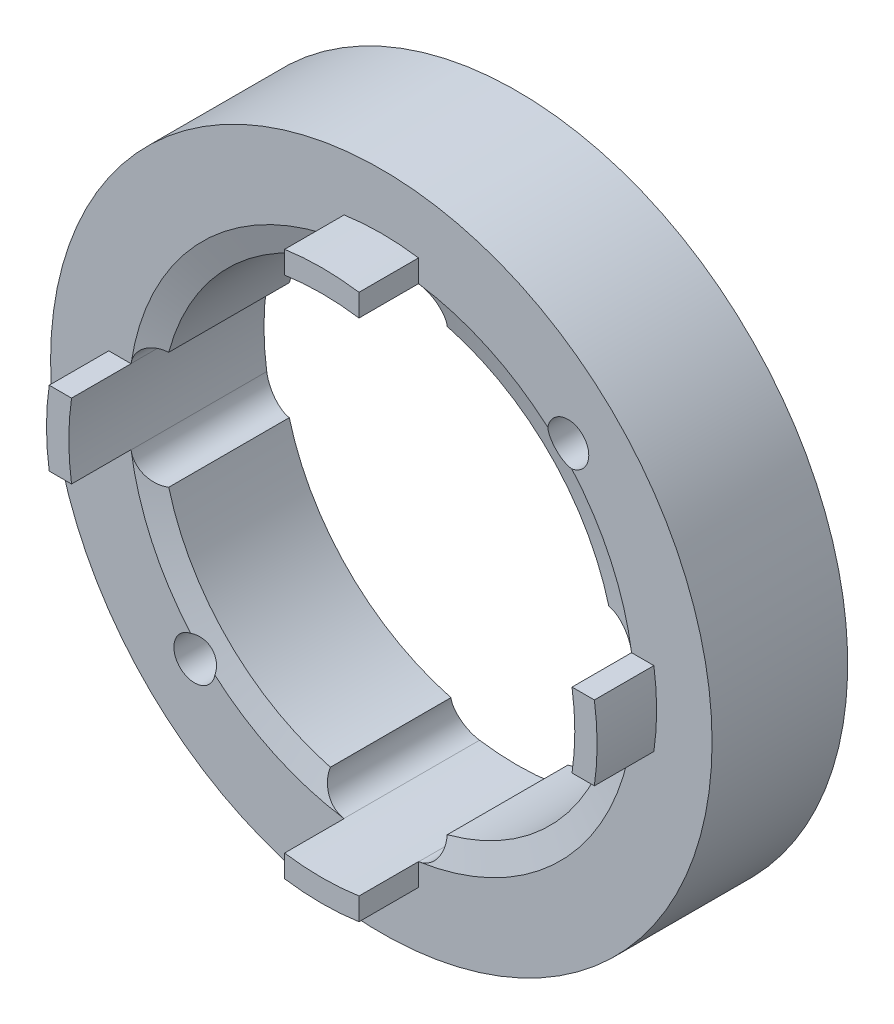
ISO-10303-21;
HEADER;
FILE_DESCRIPTION(('STEP AP214'),'2;1');
FILE_NAME('part.step','',(''),(''),'','','');
FILE_SCHEMA(('AUTOMOTIVE_DESIGN { 1 0 10303 214 1 1 1 1 }'));
ENDSEC;
DATA;
#1=APPLICATION_CONTEXT('core data for automotive mechanical design processes');
#2=APPLICATION_PROTOCOL_DEFINITION('international standard','automotive_design',2000,#1);
#3=PRODUCT_CONTEXT('',#1,'mechanical');
#4=PRODUCT('Part','Part','',(#3));
#5=PRODUCT_RELATED_PRODUCT_CATEGORY('part','',(#4));
#6=PRODUCT_DEFINITION_FORMATION('','',#4);
#7=PRODUCT_DEFINITION_CONTEXT('part definition',#1,'design');
#8=PRODUCT_DEFINITION('design','',#6,#7);
#9=PRODUCT_DEFINITION_SHAPE('','',#8);
#10=(LENGTH_UNIT() NAMED_UNIT(*) SI_UNIT(.MILLI.,.METRE.));
#11=(NAMED_UNIT(*) PLANE_ANGLE_UNIT() SI_UNIT($,.RADIAN.));
#12=(NAMED_UNIT(*) SI_UNIT($,.STERADIAN.) SOLID_ANGLE_UNIT());
#13=UNCERTAINTY_MEASURE_WITH_UNIT(LENGTH_MEASURE(1.E-05),#10,'distance_accuracy_value','');
#14=(GEOMETRIC_REPRESENTATION_CONTEXT(3) GLOBAL_UNCERTAINTY_ASSIGNED_CONTEXT((#13)) GLOBAL_UNIT_ASSIGNED_CONTEXT((#10,
#11,#12)) REPRESENTATION_CONTEXT('',''));
#15=CARTESIAN_POINT('',(0.,0.,0.));
#16=DIRECTION('',(0.,0.,1.));
#17=DIRECTION('',(1.,0.,0.));
#18=AXIS2_PLACEMENT_3D('',#15,#16,#17);
#19=CARTESIAN_POINT('',(0.,0.,-0.000999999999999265));
#20=DIRECTION('',(0.,0.,1.));
#21=DIRECTION('',(1.,0.,0.));
#22=AXIS2_PLACEMENT_3D('',#19,#20,#21);
#23=CYLINDRICAL_SURFACE('',#22,15.3);
#24=CARTESIAN_POINT('',(0.,0.,8.9963402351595));
#25=DIRECTION('',(0.,0.,1.));
#26=DIRECTION('',(1.,0.,0.));
#27=AXIS2_PLACEMENT_3D('',#24,#25,#26);
#28=CIRCLE('',#27,15.3);
#29=CARTESIAN_POINT('',(14.7876477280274,3.92625453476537,8.9963402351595));
#30=VERTEX_POINT('',#29);
#31=CARTESIAN_POINT('',(3.92625453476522,14.7876477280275,8.9963402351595));
#32=VERTEX_POINT('',#31);
#33=EDGE_CURVE('E578',#30,#32,#28,.T.);
#34=ORIENTED_EDGE('',*,*,#33,.T.);
#35=DIRECTION('',(0.,0.,1.));
#36=VECTOR('',#35,1.);
#37=CARTESIAN_POINT('',(3.92625453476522,14.7876477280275,4.94660651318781));
#38=LINE('',#37,#36);
#39=CARTESIAN_POINT('',(3.92625453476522,14.7876477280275,0.89687279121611));
#40=VERTEX_POINT('',#39);
#41=EDGE_CURVE('E494',#32,#40,#38,.F.);
#42=ORIENTED_EDGE('',*,*,#41,.T.);
#43=CARTESIAN_POINT('',(0.,0.,0.89687279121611));
#44=DIRECTION('',(0.,0.,-1.));
#45=DIRECTION('',(-1.,0.,0.));
#46=AXIS2_PLACEMENT_3D('',#43,#44,#45);
#47=CIRCLE('',#46,15.3);
#48=CARTESIAN_POINT('',(14.7876477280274,3.92625453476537,0.896872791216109));
#49=VERTEX_POINT('',#48);
#50=EDGE_CURVE('E596',#40,#49,#47,.T.);
#51=ORIENTED_EDGE('',*,*,#50,.T.);
#52=DIRECTION('',(0.,0.,1.));
#53=VECTOR('',#52,1.);
#54=CARTESIAN_POINT('',(14.7876477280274,3.92625453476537,4.94660651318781));
#55=LINE('',#54,#53);
#56=EDGE_CURVE('E525',#49,#30,#55,.T.);
#57=ORIENTED_EDGE('',*,*,#56,.T.);
#58=EDGE_LOOP('',(#34,#42,#51,#57));
#59=FACE_BOUND('',#58,.T.);
#60=ADVANCED_FACE('F35',(#59),#23,.F.);
#61=CARTESIAN_POINT('',(0.,0.,8.90745910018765));
#62=DIRECTION('',(0.,0.,1.));
#63=DIRECTION('',(1.,0.,0.));
#64=AXIS2_PLACEMENT_3D('',#61,#62,#63);
#65=CONICAL_SURFACE('',#64,15.,1.28276464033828);
#66=CARTESIAN_POINT('',(0.,0.,9.5));
#67=DIRECTION('',(0.,0.,-1.));
#68=DIRECTION('',(-1.,0.,0.));
#69=AXIS2_PLACEMENT_3D('',#66,#67,#68);
#70=CIRCLE('',#69,17.);
#71=CARTESIAN_POINT('',(12.8022612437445,11.1849053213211,9.5));
#72=VERTEX_POINT('',#71);
#73=CARTESIAN_POINT('',(16.8132696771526,2.51275998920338,9.5));
#74=VERTEX_POINT('',#73);
#75=EDGE_CURVE('E591',#72,#74,#70,.T.);
#76=ORIENTED_EDGE('',*,*,#75,.F.);
#77=CARTESIAN_POINT('',(12.8030334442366,11.1850474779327,9.50020000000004));
#78=CARTESIAN_POINT('',(12.7651853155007,11.1780697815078,9.49039544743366));
#79=CARTESIAN_POINT('',(12.727003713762,11.1726561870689,9.48083114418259));
#80=CARTESIAN_POINT('',(12.6501838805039,11.1650159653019,9.46225155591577));
#81=CARTESIAN_POINT('',(12.6115455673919,11.1627899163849,9.45323637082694));
#82=CARTESIAN_POINT('',(12.495259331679,11.1609838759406,9.42711744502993));
#83=CARTESIAN_POINT('',(12.4172625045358,11.1662801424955,9.41094615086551));
#84=CARTESIAN_POINT('',(12.2625987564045,11.1900612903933,9.38171593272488));
#85=CARTESIAN_POINT('',(12.1859341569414,11.208567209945,9.3686620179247));
#86=CARTESIAN_POINT('',(12.0364149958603,11.2585030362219,9.34624510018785));
#87=CARTESIAN_POINT('',(11.9635569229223,11.2899207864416,9.33687864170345));
#88=CARTESIAN_POINT('',(11.8262438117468,11.363684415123,9.32249124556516));
#89=CARTESIAN_POINT('',(11.7615911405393,11.4056366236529,9.3173374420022));
#90=CARTESIAN_POINT('',(11.6399783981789,11.4997855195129,9.31110007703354));
#91=CARTESIAN_POINT('',(11.5830195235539,11.5519837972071,9.31001714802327));
#92=CARTESIAN_POINT('',(11.4801200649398,11.6633644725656,9.31194457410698));
#93=CARTESIAN_POINT('',(11.4339028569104,11.7222938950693,9.31483451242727));
#94=CARTESIAN_POINT('',(11.3516470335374,11.8465705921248,9.32436742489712));
#95=CARTESIAN_POINT('',(11.3156055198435,11.9119160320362,9.33100932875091));
#96=CARTESIAN_POINT('',(11.2544742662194,12.0473121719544,9.34778877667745));
#97=CARTESIAN_POINT('',(11.2294125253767,12.1173743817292,9.35793514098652));
#98=CARTESIAN_POINT('',(11.1908291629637,12.260142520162,9.38132972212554));
#99=CARTESIAN_POINT('',(11.1773135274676,12.3328497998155,9.39457954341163));
#100=CARTESIAN_POINT('',(11.162635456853,12.4724647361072,9.42240965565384));
#101=CARTESIAN_POINT('',(11.1604857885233,12.5393163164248,9.43676848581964));
#102=CARTESIAN_POINT('',(11.1656984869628,12.6721397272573,9.46725327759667));
#103=CARTESIAN_POINT('',(11.1730467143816,12.7381127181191,9.4833765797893));
#104=CARTESIAN_POINT('',(11.1850474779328,12.8030334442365,9.50020000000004));
#105=B_SPLINE_CURVE_WITH_KNOTS('',3,(#77,#78,#79,#80,#81,#82,#83,#84,#85,#86,#87,#88,#89,#90,
#91,#92,#93,#94,#95,#96,#97,#98,#99,#100,#101,#102,#103,#104),.UNSPECIFIED.,.F.,.F.,(4,2,2,2,2,
2,2,2,2,2,2,2,2,4),(0.,0.119078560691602,0.238178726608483,0.47644870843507,0.715099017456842,
0.95352514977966,1.18410472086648,1.41472011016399,1.63849758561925,1.86221125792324,
2.08649213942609,2.31088922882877,2.51543094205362,2.71966850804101),.UNSPECIFIED.);
#106=CARTESIAN_POINT('',(11.1849053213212,12.8022612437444,9.5));
#107=VERTEX_POINT('',#106);
#108=EDGE_CURVE('E446',#72,#107,#105,.T.);
#109=ORIENTED_EDGE('',*,*,#108,.T.);
#110=CARTESIAN_POINT('',(2.51275998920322,16.8132696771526,9.5));
#111=VERTEX_POINT('',#110);
#112=EDGE_CURVE('E597',#111,#107,#70,.T.);
#113=ORIENTED_EDGE('',*,*,#112,.F.);
#114=CARTESIAN_POINT('',(2.51141809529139,16.8134696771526,9.49999985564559));
#115=CARTESIAN_POINT('',(2.55753964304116,16.8066149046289,9.5000096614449));
#116=CARTESIAN_POINT('',(2.6033564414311,16.7978636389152,9.49950785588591));
#117=CARTESIAN_POINT('',(2.69409119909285,16.7766382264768,9.49748597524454));
#118=CARTESIAN_POINT('',(2.73900925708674,16.7641644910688,9.49596601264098));
#119=CARTESIAN_POINT('',(2.87177084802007,16.7213346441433,9.48989647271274));
#120=CARTESIAN_POINT('',(2.95785956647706,16.6855342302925,9.48383723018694));
#121=CARTESIAN_POINT('',(3.12273041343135,16.6005711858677,9.46785238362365));
#122=CARTESIAN_POINT('',(3.20151127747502,16.5514062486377,9.45792611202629));
#123=CARTESIAN_POINT('',(3.34971726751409,16.4412442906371,9.43446524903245));
#124=CARTESIAN_POINT('',(3.41914146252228,16.3802460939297,9.42093029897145));
#125=CARTESIAN_POINT('',(3.54775723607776,16.2473661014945,9.39038531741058));
#126=CARTESIAN_POINT('',(3.60679600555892,16.1753469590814,9.37333032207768));
#127=CARTESIAN_POINT('',(3.7120879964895,16.0231840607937,9.33628454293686));
#128=CARTESIAN_POINT('',(3.75833962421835,15.9430392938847,9.31629339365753));
#129=CARTESIAN_POINT('',(3.83834873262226,15.7742048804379,9.27316774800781));
#130=CARTESIAN_POINT('',(3.87165859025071,15.6853237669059,9.24995308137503));
#131=CARTESIAN_POINT('',(3.92300425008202,15.5037712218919,9.20145777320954));
#132=CARTESIAN_POINT('',(3.94103496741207,15.4110985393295,9.17617644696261));
#133=CARTESIAN_POINT('',(3.961048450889,15.2290860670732,9.12544101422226));
#134=CARTESIAN_POINT('',(3.96377930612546,15.1398075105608,9.10005701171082));
#135=CARTESIAN_POINT('',(3.95533268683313,14.9621958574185,9.04853341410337));
#136=CARTESIAN_POINT('',(3.94416466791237,14.8738621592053,9.02239434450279));
#137=CARTESIAN_POINT('',(3.92611747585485,14.7869856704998,8.9961402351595));
#138=B_SPLINE_CURVE_WITH_KNOTS('',3,(#114,#115,#116,#117,#118,#119,#120,#121,#122,#123,#124,
#125,#126,#127,#128,#129,#130,#131,#132,#133,#134,#135,#136,#137),.UNSPECIFIED.,.F.,.F.,(4,2,2,
2,2,2,2,2,2,2,2,4),(0.,0.139797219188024,0.279578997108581,0.558430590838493,0.837330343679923,
1.11625782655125,1.39899723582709,1.68177186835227,1.97360349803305,2.26553221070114,
2.54305352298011,2.82038613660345),.UNSPECIFIED.);
#139=EDGE_CURVE('E438',#111,#32,#138,.T.);
#140=ORIENTED_EDGE('',*,*,#139,.T.);
#141=ORIENTED_EDGE('',*,*,#33,.F.);
#142=CARTESIAN_POINT('',(14.7869856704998,3.92611747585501,8.9961402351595));
#143=CARTESIAN_POINT('',(14.8352132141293,3.9361100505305,9.01071028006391));
#144=CARTESIAN_POINT('',(14.8838618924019,3.94400569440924,9.02524084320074));
#145=CARTESIAN_POINT('',(14.9817102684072,3.95555029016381,9.05414107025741));
#146=CARTESIAN_POINT('',(15.0309099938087,3.95919902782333,9.06851072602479));
#147=CARTESIAN_POINT('',(15.1788473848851,3.96369309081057,9.11124048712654));
#148=CARTESIAN_POINT('',(15.2779668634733,3.95809528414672,9.13923454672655));
#149=CARTESIAN_POINT('',(15.4742486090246,3.92962139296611,9.19346793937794));
#150=CARTESIAN_POINT('',(15.5714088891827,3.90672859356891,9.2197055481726));
#151=CARTESIAN_POINT('',(15.7607693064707,3.84404832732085,9.26970666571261));
#152=CARTESIAN_POINT('',(15.8529720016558,3.80426966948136,9.29347145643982));
#153=CARTESIAN_POINT('',(16.0276623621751,3.70970601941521,9.33742151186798));
#154=CARTESIAN_POINT('',(16.1103126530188,3.65525162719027,9.35767114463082));
#155=CARTESIAN_POINT('',(16.2653947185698,3.53233790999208,9.39463324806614));
#156=CARTESIAN_POINT('',(16.3378264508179,3.46387852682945,9.4113457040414));
#157=CARTESIAN_POINT('',(16.467576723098,3.31756236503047,9.44022017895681));
#158=CARTESIAN_POINT('',(16.5253451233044,3.2401321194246,9.45252423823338));
#159=CARTESIAN_POINT('',(16.627093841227,3.07622885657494,9.47304877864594));
#160=CARTESIAN_POINT('',(16.671084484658,2.98976267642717,9.48127232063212));
#161=CARTESIAN_POINT('',(16.73269903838,2.83777493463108,9.49155668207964));
#162=CARTESIAN_POINT('',(16.7542727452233,2.77389661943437,9.49473169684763));
#163=CARTESIAN_POINT('',(16.7897125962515,2.64402637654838,9.49896118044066));
#164=CARTESIAN_POINT('',(16.8035850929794,2.57803623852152,9.50001739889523));
#165=CARTESIAN_POINT('',(16.8134696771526,2.51141809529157,9.49999985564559));
#166=B_SPLINE_CURVE_WITH_KNOTS('',3,(#142,#143,#144,#145,#146,#147,#148,#149,#150,#151,#152,
#153,#154,#155,#156,#157,#158,#159,#160,#161,#162,#163,#164,#165),.UNSPECIFIED.,.F.,.F.,(4,2,2,
2,2,2,2,2,2,2,2,4),(0.,0.153993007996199,0.307993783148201,0.615857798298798,0.924019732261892,
1.23202110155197,1.53359278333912,1.8351657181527,2.12589248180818,2.41640083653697,
2.61841535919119,2.82026299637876),.UNSPECIFIED.);
#167=EDGE_CURVE('E421',#30,#74,#166,.T.);
#168=ORIENTED_EDGE('',*,*,#167,.T.);
#169=EDGE_LOOP('',(#76,#109,#113,#140,#141,#168));
#170=FACE_BOUND('',#169,.T.);
#171=ADVANCED_FACE('F388',(#170),#65,.F.);
#172=CARTESIAN_POINT('',(0.,0.,0.386524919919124));
#173=DIRECTION('',(0.,0.,-1.));
#174=DIRECTION('',(-1.,0.,0.));
#175=AXIS2_PLACEMENT_3D('',#172,#173,#174);
#176=CONICAL_SURFACE('',#175,17.,1.27915180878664);
#177=CARTESIAN_POINT('',(0.,0.,0.386524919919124));
#178=DIRECTION('',(0.,0.,-1.));
#179=DIRECTION('',(-1.,0.,0.));
#180=AXIS2_PLACEMENT_3D('',#177,#178,#179);
#181=CIRCLE('',#180,17.);
#182=CARTESIAN_POINT('',(2.51275998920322,16.8132696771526,0.386524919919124));
#183=VERTEX_POINT('',#182);
#184=CARTESIAN_POINT('',(11.1849053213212,12.8022612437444,0.386524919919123));
#185=VERTEX_POINT('',#184);
#186=EDGE_CURVE('E296',#183,#185,#181,.T.);
#187=ORIENTED_EDGE('',*,*,#186,.T.);
#188=CARTESIAN_POINT('',(11.1850456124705,12.8030233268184,0.386324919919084));
#189=CARTESIAN_POINT('',(11.1780706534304,12.7651883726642,0.396256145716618));
#190=CARTESIAN_POINT('',(11.1726583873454,12.7270186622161,0.405944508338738));
#191=CARTESIAN_POINT('',(11.1650187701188,12.6502192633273,0.424766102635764));
#192=CARTESIAN_POINT('',(11.1627920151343,12.6115894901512,0.433899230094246));
#193=CARTESIAN_POINT('',(11.1609819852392,12.495319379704,0.460362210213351));
#194=CARTESIAN_POINT('',(11.1662738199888,12.4173245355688,0.476748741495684));
#195=CARTESIAN_POINT('',(11.1900506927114,12.2626467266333,0.506371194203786));
#196=CARTESIAN_POINT('',(11.2085571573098,12.1859660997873,0.519601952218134));
#197=CARTESIAN_POINT('',(11.2585057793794,12.0364049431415,0.542323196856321));
#198=CARTESIAN_POINT('',(11.289935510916,11.9635208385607,0.551817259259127));
#199=CARTESIAN_POINT('',(11.363705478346,11.8262129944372,0.566393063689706));
#200=CARTESIAN_POINT('',(11.4056415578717,11.761586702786,0.571612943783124));
#201=CARTESIAN_POINT('',(11.4997538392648,11.6400173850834,0.577931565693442));
#202=CARTESIAN_POINT('',(11.5519316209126,11.5830755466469,0.579029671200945));
#203=CARTESIAN_POINT('',(11.6632224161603,11.480243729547,0.577081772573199));
#204=CARTESIAN_POINT('',(11.7220762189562,11.4340702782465,0.57416079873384));
#205=CARTESIAN_POINT('',(11.8461836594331,11.3518799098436,0.56452511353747));
#206=CARTESIAN_POINT('',(11.9114354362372,11.3158600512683,0.557811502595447));
#207=CARTESIAN_POINT('',(12.0466311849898,11.2547444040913,0.540851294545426));
#208=CARTESIAN_POINT('',(12.1165868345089,11.2296770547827,0.530595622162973));
#209=CARTESIAN_POINT('',(12.2591310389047,11.1910514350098,0.506950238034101));
#210=CARTESIAN_POINT('',(12.3317209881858,11.1774993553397,0.49355884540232));
#211=CARTESIAN_POINT('',(12.4714301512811,11.162683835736,0.465367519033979));
#212=CARTESIAN_POINT('',(12.5384963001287,11.1604831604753,0.450780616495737));
#213=CARTESIAN_POINT('',(12.6717366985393,11.1656532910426,0.419806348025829));
#214=CARTESIAN_POINT('',(12.7379121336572,11.1730097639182,0.403421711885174));
#215=CARTESIAN_POINT('',(12.8030233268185,11.1850456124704,0.386324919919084));
#216=B_SPLINE_CURVE_WITH_KNOTS('',3,(#188,#189,#190,#191,#192,#193,#194,#195,#196,#197,#198,
#199,#200,#201,#202,#203,#204,#205,#206,#207,#208,#209,#210,#211,#212,#213,#214,#215),
.UNSPECIFIED.,.F.,.F.,(4,2,2,2,2,2,2,2,2,2,2,2,2,4),(0.,0.119133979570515,0.238290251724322,
0.476684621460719,0.715466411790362,0.954019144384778,1.1845184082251,1.4150532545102,
1.63857621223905,1.86203434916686,2.08606931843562,2.31022465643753,2.51553721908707,
2.7205422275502),.UNSPECIFIED.);
#217=CARTESIAN_POINT('',(12.8022612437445,11.1849053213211,0.386524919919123));
#218=VERTEX_POINT('',#217);
#219=EDGE_CURVE('E455',#185,#218,#216,.T.);
#220=ORIENTED_EDGE('',*,*,#219,.T.);
#221=CARTESIAN_POINT('',(16.8132696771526,2.51275998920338,0.386524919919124));
#222=VERTEX_POINT('',#221);
#223=EDGE_CURVE('E289',#218,#222,#181,.T.);
#224=ORIENTED_EDGE('',*,*,#223,.T.);
#225=CARTESIAN_POINT('',(16.8134696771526,2.51141809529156,0.386525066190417));
#226=CARTESIAN_POINT('',(16.8066193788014,2.55750967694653,0.386515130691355));
#227=CARTESIAN_POINT('',(16.7978750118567,2.6032968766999,0.387022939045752));
#228=CARTESIAN_POINT('',(16.7766683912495,2.69397318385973,0.389068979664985));
#229=CARTESIAN_POINT('',(16.7642065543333,2.73886239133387,0.390607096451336));
#230=CARTESIAN_POINT('',(16.7214206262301,2.87153700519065,0.396748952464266));
#231=CARTESIAN_POINT('',(16.6856601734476,2.95756904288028,0.402880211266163));
#232=CARTESIAN_POINT('',(16.6008001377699,3.12233214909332,0.419053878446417));
#233=CARTESIAN_POINT('',(16.5516983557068,3.20106201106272,0.429096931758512));
#234=CARTESIAN_POINT('',(16.4416870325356,3.34917751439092,0.452831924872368));
#235=CARTESIAN_POINT('',(16.3807762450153,3.4185621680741,0.46652424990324));
#236=CARTESIAN_POINT('',(16.2480749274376,3.54713762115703,0.497426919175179));
#237=CARTESIAN_POINT('',(16.1761440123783,3.60617209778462,0.514683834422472));
#238=CARTESIAN_POINT('',(16.0241757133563,3.71147335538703,0.552165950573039));
#239=CARTESIAN_POINT('',(15.9441373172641,3.75773853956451,0.5723915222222));
#240=CARTESIAN_POINT('',(15.7754663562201,3.8378331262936,0.616037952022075));
#241=CARTESIAN_POINT('',(15.6866378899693,3.87120430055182,0.639541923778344));
#242=CARTESIAN_POINT('',(15.5051933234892,3.92268352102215,0.688641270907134));
#243=CARTESIAN_POINT('',(15.4125759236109,3.94078628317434,0.714237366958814));
#244=CARTESIAN_POINT('',(15.2303636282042,3.96098879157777,0.765691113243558));
#245=CARTESIAN_POINT('',(15.1408261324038,3.96378755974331,0.791482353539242));
#246=CARTESIAN_POINT('',(14.9627019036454,3.95539676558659,0.843834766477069));
#247=CARTESIAN_POINT('',(14.8741145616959,3.94421677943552,0.870395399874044));
#248=CARTESIAN_POINT('',(14.7869943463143,3.92611927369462,0.897072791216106));
#249=B_SPLINE_CURVE_WITH_KNOTS('',3,(#225,#226,#227,#228,#229,#230,#231,#232,#233,#234,#235,
#236,#237,#238,#239,#240,#241,#242,#243,#244,#245,#246,#247,#248),.UNSPECIFIED.,.F.,.F.,(4,2,2,
2,2,2,2,2,2,2,2,4),(0.,0.139706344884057,0.279397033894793,0.558060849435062,0.836770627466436,
1.11550983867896,1.39815161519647,1.68082872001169,1.97278787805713,2.26484803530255,
2.5434492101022,2.82185963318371),.UNSPECIFIED.);
#250=EDGE_CURVE('E518',#222,#49,#249,.T.);
#251=ORIENTED_EDGE('',*,*,#250,.T.);
#252=ORIENTED_EDGE('',*,*,#50,.F.);
#253=CARTESIAN_POINT('',(3.92611927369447,14.7869943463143,0.897072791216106));
#254=CARTESIAN_POINT('',(3.93611937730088,14.8352596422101,0.882297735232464));
#255=CARTESIAN_POINT('',(3.94401938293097,14.8839469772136,0.867562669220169));
#256=CARTESIAN_POINT('',(3.95556600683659,14.9818745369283,0.838255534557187));
#257=CARTESIAN_POINT('',(3.95921239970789,15.0311147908,0.823683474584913));
#258=CARTESIAN_POINT('',(3.96368887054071,15.1791795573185,0.780350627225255));
#259=CARTESIAN_POINT('',(3.9580645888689,15.2783884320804,0.751960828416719));
#260=CARTESIAN_POINT('',(3.92950292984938,15.4748536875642,0.696960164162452));
#261=CARTESIAN_POINT('',(3.90654857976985,15.5721080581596,0.670351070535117));
#262=CARTESIAN_POINT('',(3.84370445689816,15.761651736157,0.619643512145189));
#263=CARTESIAN_POINT('',(3.8038236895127,15.85394365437,0.595543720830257));
#264=CARTESIAN_POINT('',(3.70904172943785,16.0287431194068,0.550991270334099));
#265=CARTESIAN_POINT('',(3.65448123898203,16.1114181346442,0.530471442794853));
#266=CARTESIAN_POINT('',(3.53132828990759,16.2665332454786,0.49302129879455));
#267=CARTESIAN_POINT('',(3.46273581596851,16.3389733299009,0.476090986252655));
#268=CARTESIAN_POINT('',(3.31620535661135,16.4686491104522,0.446863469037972));
#269=CARTESIAN_POINT('',(3.23870571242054,16.526347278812,0.434418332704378));
#270=CARTESIAN_POINT('',(3.07466563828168,16.6279456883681,0.413667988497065));
#271=CARTESIAN_POINT('',(2.98813217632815,16.6718564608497,0.405359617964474));
#272=CARTESIAN_POINT('',(2.83633759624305,16.7332030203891,0.395002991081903));
#273=CARTESIAN_POINT('',(2.77273219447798,16.7546275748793,0.39181483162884));
#274=CARTESIAN_POINT('',(2.64343024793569,16.7898376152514,0.387567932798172));
#275=CARTESIAN_POINT('',(2.57773549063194,16.8036294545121,0.386507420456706));
#276=CARTESIAN_POINT('',(2.51141809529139,16.8134696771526,0.386525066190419));
#277=B_SPLINE_CURVE_WITH_KNOTS('',3,(#253,#254,#255,#256,#257,#258,#259,#260,#261,#262,#263,
#264,#265,#266,#267,#268,#269,#270,#271,#272,#273,#274,#275,#276),.UNSPECIFIED.,.F.,.F.,(4,2,2,
2,2,2,2,2,2,2,2,4),(0.,0.154279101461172,0.308566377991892,0.617013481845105,0.925763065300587,
1.23434858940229,1.53631191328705,1.83827556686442,2.12909475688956,2.41969126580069,
2.62079595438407,2.82173299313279),.UNSPECIFIED.);
#278=EDGE_CURVE('E491',#40,#183,#277,.T.);
#279=ORIENTED_EDGE('',*,*,#278,.T.);
#280=EDGE_LOOP('',(#187,#220,#224,#251,#252,#279));
#281=FACE_BOUND('',#280,.T.);
#282=ADVANCED_FACE('F543',(#281),#176,.F.);
#283=CARTESIAN_POINT('',(3.92625453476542,-14.7876477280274,8.9963402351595));
#284=VERTEX_POINT('',#283);
#285=CARTESIAN_POINT('',(14.7876477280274,-3.92625453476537,8.9963402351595));
#286=VERTEX_POINT('',#285);
#287=EDGE_CURVE('E572',#284,#286,#28,.T.);
#288=ORIENTED_EDGE('',*,*,#287,.T.);
#289=DIRECTION('',(0.,0.,1.));
#290=VECTOR('',#289,1.);
#291=CARTESIAN_POINT('',(14.7876477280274,-3.92625453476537,4.94326245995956));
#292=LINE('',#291,#290);
#293=CARTESIAN_POINT('',(14.7876477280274,-3.92625453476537,0.896872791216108));
#294=VERTEX_POINT('',#293);
#295=EDGE_CURVE('E652',#286,#294,#292,.F.);
#296=ORIENTED_EDGE('',*,*,#295,.T.);
#297=CARTESIAN_POINT('',(3.92625453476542,-14.7876477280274,0.896872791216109));
#298=VERTEX_POINT('',#297);
#299=EDGE_CURVE('E644',#294,#298,#47,.T.);
#300=ORIENTED_EDGE('',*,*,#299,.T.);
#301=DIRECTION('',(0.,0.,1.));
#302=VECTOR('',#301,1.);
#303=CARTESIAN_POINT('',(3.92625453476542,-14.7876477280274,4.94660651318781));
#304=LINE('',#303,#302);
#305=EDGE_CURVE('E328',#298,#284,#304,.T.);
#306=ORIENTED_EDGE('',*,*,#305,.T.);
#307=EDGE_LOOP('',(#288,#296,#300,#306));
#308=FACE_BOUND('',#307,.T.);
#309=ADVANCED_FACE('F539',(#308),#23,.F.);
#310=CARTESIAN_POINT('',(16.8132696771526,-2.51275998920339,9.5));
#311=VERTEX_POINT('',#310);
#312=CARTESIAN_POINT('',(2.51275998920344,-16.8132696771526,9.5));
#313=VERTEX_POINT('',#312);
#314=EDGE_CURVE('E595',#311,#313,#70,.T.);
#315=ORIENTED_EDGE('',*,*,#314,.F.);
#316=CARTESIAN_POINT('',(16.8134696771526,-2.51141809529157,9.49999985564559));
#317=CARTESIAN_POINT('',(16.8066149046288,-2.55753964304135,9.5000096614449));
#318=CARTESIAN_POINT('',(16.7978636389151,-2.60335644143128,9.49950785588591));
#319=CARTESIAN_POINT('',(16.7766382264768,-2.69409119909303,9.49748597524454));
#320=CARTESIAN_POINT('',(16.7641644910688,-2.73900925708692,9.49596601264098));
#321=CARTESIAN_POINT('',(16.7213346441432,-2.87177084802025,9.48989647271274));
#322=CARTESIAN_POINT('',(16.6855342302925,-2.95785956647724,9.48383723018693));
#323=CARTESIAN_POINT('',(16.6005711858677,-3.12273041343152,9.46785238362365));
#324=CARTESIAN_POINT('',(16.5514062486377,-3.2015112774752,9.45792611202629));
#325=CARTESIAN_POINT('',(16.441244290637,-3.34971726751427,9.43446524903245));
#326=CARTESIAN_POINT('',(16.3802460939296,-3.41914146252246,9.42093029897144));
#327=CARTESIAN_POINT('',(16.2473661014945,-3.54775723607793,9.39038531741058));
#328=CARTESIAN_POINT('',(16.1753469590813,-3.60679600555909,9.37333032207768));
#329=CARTESIAN_POINT('',(16.0231840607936,-3.71208799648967,9.33628454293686));
#330=CARTESIAN_POINT('',(15.9430392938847,-3.75833962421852,9.31629339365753));
#331=CARTESIAN_POINT('',(15.7742048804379,-3.83834873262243,9.27316774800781));
#332=CARTESIAN_POINT('',(15.6853237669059,-3.87165859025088,9.24995308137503));
#333=CARTESIAN_POINT('',(15.5037712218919,-3.92300425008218,9.20145777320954));
#334=CARTESIAN_POINT('',(15.4110985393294,-3.94103496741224,9.17617644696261));
#335=CARTESIAN_POINT('',(15.2290860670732,-3.96104845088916,9.12544101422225));
#336=CARTESIAN_POINT('',(15.1398075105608,-3.96377930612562,9.10005701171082));
#337=CARTESIAN_POINT('',(14.9621958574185,-3.95533268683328,9.04853341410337));
#338=CARTESIAN_POINT('',(14.8738621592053,-3.94416466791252,9.02239434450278));
#339=CARTESIAN_POINT('',(14.7869856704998,-3.92611747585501,8.9961402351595));
#340=B_SPLINE_CURVE_WITH_KNOTS('',3,(#316,#317,#318,#319,#320,#321,#322,#323,#324,#325,#326,
#327,#328,#329,#330,#331,#332,#333,#334,#335,#336,#337,#338,#339),.UNSPECIFIED.,.F.,.F.,(4,2,2,
2,2,2,2,2,2,2,2,4),(0.,0.139797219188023,0.27957899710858,0.558430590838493,0.837330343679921,
1.11625782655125,1.39899723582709,1.68177186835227,1.97360349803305,2.26553221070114,
2.54305352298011,2.82038613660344),.UNSPECIFIED.);
#341=EDGE_CURVE('E342',#311,#286,#340,.T.);
#342=ORIENTED_EDGE('',*,*,#341,.T.);
#343=ORIENTED_EDGE('',*,*,#287,.F.);
#344=CARTESIAN_POINT('',(3.92611747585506,-14.7869856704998,8.9961402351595));
#345=CARTESIAN_POINT('',(3.93611005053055,-14.8352132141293,9.01071028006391));
#346=CARTESIAN_POINT('',(3.94400569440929,-14.8838618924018,9.02524084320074));
#347=CARTESIAN_POINT('',(3.95555029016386,-14.9817102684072,9.05414107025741));
#348=CARTESIAN_POINT('',(3.95919902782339,-15.0309099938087,9.06851072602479));
#349=CARTESIAN_POINT('',(3.96369309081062,-15.1788473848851,9.11124048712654));
#350=CARTESIAN_POINT('',(3.95809528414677,-15.2779668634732,9.13923454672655));
#351=CARTESIAN_POINT('',(3.92962139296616,-15.4742486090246,9.19346793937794));
#352=CARTESIAN_POINT('',(3.90672859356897,-15.5714088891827,9.2197055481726));
#353=CARTESIAN_POINT('',(3.84404832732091,-15.7607693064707,9.26970666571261));
#354=CARTESIAN_POINT('',(3.80426966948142,-15.8529720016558,9.29347145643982));
#355=CARTESIAN_POINT('',(3.70970601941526,-16.0276623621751,9.33742151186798));
#356=CARTESIAN_POINT('',(3.65525162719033,-16.1103126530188,9.35767114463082));
#357=CARTESIAN_POINT('',(3.53233790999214,-16.2653947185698,9.39463324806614));
#358=CARTESIAN_POINT('',(3.46387852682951,-16.3378264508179,9.4113457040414));
#359=CARTESIAN_POINT('',(3.31756236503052,-16.467576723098,9.44022017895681));
#360=CARTESIAN_POINT('',(3.24013211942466,-16.5253451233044,9.45252423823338));
#361=CARTESIAN_POINT('',(3.07622885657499,-16.627093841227,9.47304877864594));
#362=CARTESIAN_POINT('',(2.98976267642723,-16.671084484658,9.48127232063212));
#363=CARTESIAN_POINT('',(2.83777493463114,-16.73269903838,9.49155668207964));
#364=CARTESIAN_POINT('',(2.77389661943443,-16.7542727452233,9.49473169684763));
#365=CARTESIAN_POINT('',(2.64402637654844,-16.7897125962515,9.49896118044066));
#366=CARTESIAN_POINT('',(2.57803623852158,-16.8035850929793,9.50001739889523));
#367=CARTESIAN_POINT('',(2.51141809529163,-16.8134696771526,9.49999985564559));
#368=B_SPLINE_CURVE_WITH_KNOTS('',3,(#344,#345,#346,#347,#348,#349,#350,#351,#352,#353,#354,
#355,#356,#357,#358,#359,#360,#361,#362,#363,#364,#365,#366,#367),.UNSPECIFIED.,.F.,.F.,(4,2,2,
2,2,2,2,2,2,2,2,4),(0.,0.153993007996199,0.307993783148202,0.6158577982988,0.924019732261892,
1.23202110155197,1.53359278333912,1.83516571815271,2.12589248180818,2.41640083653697,
2.61841535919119,2.82026299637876),.UNSPECIFIED.);
#369=EDGE_CURVE('E372',#284,#313,#368,.T.);
#370=ORIENTED_EDGE('',*,*,#369,.T.);
#371=EDGE_LOOP('',(#315,#342,#343,#370));
#372=FACE_BOUND('',#371,.T.);
#373=ADVANCED_FACE('F544',(#372),#65,.F.);
#374=ORIENTED_EDGE('',*,*,#299,.F.);
#375=CARTESIAN_POINT('',(14.7869943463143,-3.92611927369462,0.897072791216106));
#376=CARTESIAN_POINT('',(14.8352596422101,-3.93611937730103,0.882297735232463));
#377=CARTESIAN_POINT('',(14.8839469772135,-3.94401938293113,0.867562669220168));
#378=CARTESIAN_POINT('',(14.9818745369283,-3.95556600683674,0.838255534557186));
#379=CARTESIAN_POINT('',(15.0311147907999,-3.95921239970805,0.823683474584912));
#380=CARTESIAN_POINT('',(15.1791795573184,-3.96368887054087,0.780350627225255));
#381=CARTESIAN_POINT('',(15.2783884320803,-3.95806458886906,0.751960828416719));
#382=CARTESIAN_POINT('',(15.4748536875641,-3.92950292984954,0.696960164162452));
#383=CARTESIAN_POINT('',(15.5721080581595,-3.90654857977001,0.670351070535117));
#384=CARTESIAN_POINT('',(15.7616517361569,-3.84370445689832,0.619643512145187));
#385=CARTESIAN_POINT('',(15.85394365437,-3.80382368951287,0.595543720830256));
#386=CARTESIAN_POINT('',(16.0287431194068,-3.70904172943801,0.550991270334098));
#387=CARTESIAN_POINT('',(16.1114181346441,-3.6544812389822,0.530471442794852));
#388=CARTESIAN_POINT('',(16.2665332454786,-3.53132828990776,0.493021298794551));
#389=CARTESIAN_POINT('',(16.3389733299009,-3.46273581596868,0.476090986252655));
#390=CARTESIAN_POINT('',(16.4686491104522,-3.31620535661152,0.44686346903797));
#391=CARTESIAN_POINT('',(16.5263472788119,-3.23870571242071,0.434418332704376));
#392=CARTESIAN_POINT('',(16.6279456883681,-3.07466563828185,0.413667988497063));
#393=CARTESIAN_POINT('',(16.6718564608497,-2.98813217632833,0.405359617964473));
#394=CARTESIAN_POINT('',(16.7332030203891,-2.83633759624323,0.395002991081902));
#395=CARTESIAN_POINT('',(16.7546275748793,-2.77273219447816,0.391814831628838));
#396=CARTESIAN_POINT('',(16.7898376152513,-2.64343024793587,0.387567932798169));
#397=CARTESIAN_POINT('',(16.8036294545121,-2.57773549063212,0.386507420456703));
#398=CARTESIAN_POINT('',(16.8134696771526,-2.51141809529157,0.386525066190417));
#399=B_SPLINE_CURVE_WITH_KNOTS('',3,(#375,#376,#377,#378,#379,#380,#381,#382,#383,#384,#385,
#386,#387,#388,#389,#390,#391,#392,#393,#394,#395,#396,#397,#398),.UNSPECIFIED.,.F.,.F.,(4,2,2,
2,2,2,2,2,2,2,2,4),(0.,0.154279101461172,0.308566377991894,0.617013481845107,0.92576306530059,
1.23434858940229,1.53631191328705,1.83827556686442,2.12909475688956,2.41969126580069,
2.62079595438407,2.82173299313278),.UNSPECIFIED.);
#400=CARTESIAN_POINT('',(16.8132696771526,-2.51275998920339,0.386524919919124));
#401=VERTEX_POINT('',#400);
#402=EDGE_CURVE('E317',#294,#401,#399,.T.);
#403=ORIENTED_EDGE('',*,*,#402,.T.);
#404=CARTESIAN_POINT('',(2.51275998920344,-16.8132696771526,0.386524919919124));
#405=VERTEX_POINT('',#404);
#406=EDGE_CURVE('E291',#401,#405,#181,.T.);
#407=ORIENTED_EDGE('',*,*,#406,.T.);
#408=CARTESIAN_POINT('',(2.51141809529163,-16.8134696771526,0.386525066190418));
#409=CARTESIAN_POINT('',(2.5575096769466,-16.8066193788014,0.386515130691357));
#410=CARTESIAN_POINT('',(2.60329687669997,-16.7978750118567,0.387022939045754));
#411=CARTESIAN_POINT('',(2.6939731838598,-16.7766683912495,0.389068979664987));
#412=CARTESIAN_POINT('',(2.73886239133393,-16.7642065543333,0.390607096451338));
#413=CARTESIAN_POINT('',(2.87153700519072,-16.7214206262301,0.396748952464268));
#414=CARTESIAN_POINT('',(2.95756904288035,-16.6856601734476,0.402880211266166));
#415=CARTESIAN_POINT('',(3.12233214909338,-16.6008001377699,0.41905387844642));
#416=CARTESIAN_POINT('',(3.20106201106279,-16.5516983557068,0.429096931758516));
#417=CARTESIAN_POINT('',(3.34917751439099,-16.4416870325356,0.452831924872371));
#418=CARTESIAN_POINT('',(3.41856216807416,-16.3807762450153,0.466524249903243));
#419=CARTESIAN_POINT('',(3.54713762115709,-16.2480749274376,0.497426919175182));
#420=CARTESIAN_POINT('',(3.60617209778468,-16.1761440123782,0.514683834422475));
#421=CARTESIAN_POINT('',(3.71147335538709,-16.0241757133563,0.552165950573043));
#422=CARTESIAN_POINT('',(3.75773853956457,-15.9441373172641,0.572391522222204));
#423=CARTESIAN_POINT('',(3.83783312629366,-15.7754663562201,0.616037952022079));
#424=CARTESIAN_POINT('',(3.87120430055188,-15.6866378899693,0.639541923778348));
#425=CARTESIAN_POINT('',(3.92268352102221,-15.5051933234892,0.688641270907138));
#426=CARTESIAN_POINT('',(3.9407862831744,-15.4125759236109,0.714237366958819));
#427=CARTESIAN_POINT('',(3.96098879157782,-15.2303636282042,0.765691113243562));
#428=CARTESIAN_POINT('',(3.96378755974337,-15.1408261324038,0.791482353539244));
#429=CARTESIAN_POINT('',(3.95539676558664,-14.9627019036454,0.843834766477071));
#430=CARTESIAN_POINT('',(3.94421677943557,-14.8741145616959,0.870395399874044));
#431=CARTESIAN_POINT('',(3.92611927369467,-14.7869943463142,0.897072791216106));
#432=B_SPLINE_CURVE_WITH_KNOTS('',3,(#408,#409,#410,#411,#412,#413,#414,#415,#416,#417,#418,
#419,#420,#421,#422,#423,#424,#425,#426,#427,#428,#429,#430,#431),.UNSPECIFIED.,.F.,.F.,(4,2,2,
2,2,2,2,2,2,2,2,4),(0.,0.139706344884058,0.279397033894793,0.558060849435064,0.836770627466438,
1.11550983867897,1.39815161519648,1.68082872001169,1.97278787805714,2.26484803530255,
2.54344921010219,2.82185963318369),.UNSPECIFIED.);
#433=EDGE_CURVE('E316',#405,#298,#432,.T.);
#434=ORIENTED_EDGE('',*,*,#433,.T.);
#435=EDGE_LOOP('',(#374,#403,#407,#434));
#436=FACE_BOUND('',#435,.T.);
#437=ADVANCED_FACE('F315',(#436),#176,.F.);
#438=CARTESIAN_POINT('',(-14.7876477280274,-3.92625453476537,8.9963402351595));
#439=VERTEX_POINT('',#438);
#440=CARTESIAN_POINT('',(-3.92625453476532,-14.7876477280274,8.9963402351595));
#441=VERTEX_POINT('',#440);
#442=EDGE_CURVE('E565',#439,#441,#28,.T.);
#443=ORIENTED_EDGE('',*,*,#442,.T.);
#444=DIRECTION('',(0.,0.,1.));
#445=VECTOR('',#444,1.);
#446=CARTESIAN_POINT('',(-3.92625453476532,-14.7876477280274,4.94326245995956));
#447=LINE('',#446,#445);
#448=CARTESIAN_POINT('',(-3.92625453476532,-14.7876477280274,0.896872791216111));
#449=VERTEX_POINT('',#448);
#450=EDGE_CURVE('E566',#441,#449,#447,.F.);
#451=ORIENTED_EDGE('',*,*,#450,.T.);
#452=CARTESIAN_POINT('',(-14.7876477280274,-3.92625453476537,0.896872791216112));
#453=VERTEX_POINT('',#452);
#454=EDGE_CURVE('E303',#449,#453,#47,.T.);
#455=ORIENTED_EDGE('',*,*,#454,.T.);
#456=DIRECTION('',(0.,0.,1.));
#457=VECTOR('',#456,1.);
#458=CARTESIAN_POINT('',(-14.7876477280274,-3.92625453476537,4.94326245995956));
#459=LINE('',#458,#457);
#460=EDGE_CURVE('E569',#453,#439,#459,.T.);
#461=ORIENTED_EDGE('',*,*,#460,.T.);
#462=EDGE_LOOP('',(#443,#451,#455,#461));
#463=FACE_BOUND('',#462,.T.);
#464=ADVANCED_FACE('F547',(#463),#23,.F.);
#465=CARTESIAN_POINT('',(-12.8022612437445,-11.1849053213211,9.5));
#466=VERTEX_POINT('',#465);
#467=CARTESIAN_POINT('',(-16.8132696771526,-2.51275998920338,9.5));
#468=VERTEX_POINT('',#467);
#469=EDGE_CURVE('E585',#466,#468,#70,.T.);
#470=ORIENTED_EDGE('',*,*,#469,.F.);
#471=CARTESIAN_POINT('',(-12.8030334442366,-11.1850474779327,9.50020000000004));
#472=CARTESIAN_POINT('',(-12.7651853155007,-11.1780697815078,9.49039544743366));
#473=CARTESIAN_POINT('',(-12.727003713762,-11.1726561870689,9.48083114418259));
#474=CARTESIAN_POINT('',(-12.6501838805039,-11.1650159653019,9.46225155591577));
#475=CARTESIAN_POINT('',(-12.6115455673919,-11.1627899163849,9.45323637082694));
#476=CARTESIAN_POINT('',(-12.495259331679,-11.1609838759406,9.42711744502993));
#477=CARTESIAN_POINT('',(-12.4172625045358,-11.1662801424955,9.41094615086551));
#478=CARTESIAN_POINT('',(-12.2625987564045,-11.1900612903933,9.38171593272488));
#479=CARTESIAN_POINT('',(-12.1859341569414,-11.208567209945,9.3686620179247));
#480=CARTESIAN_POINT('',(-12.0364149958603,-11.2585030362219,9.34624510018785));
#481=CARTESIAN_POINT('',(-11.9635569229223,-11.2899207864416,9.33687864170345));
#482=CARTESIAN_POINT('',(-11.8262438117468,-11.363684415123,9.32249124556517));
#483=CARTESIAN_POINT('',(-11.7615911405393,-11.4056366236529,9.3173374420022));
#484=CARTESIAN_POINT('',(-11.6399783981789,-11.4997855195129,9.31110007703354));
#485=CARTESIAN_POINT('',(-11.5830195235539,-11.5519837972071,9.31001714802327));
#486=CARTESIAN_POINT('',(-11.4801200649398,-11.6633644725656,9.31194457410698));
#487=CARTESIAN_POINT('',(-11.4339028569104,-11.7222938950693,9.31483451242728));
#488=CARTESIAN_POINT('',(-11.3516470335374,-11.8465705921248,9.32436742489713));
#489=CARTESIAN_POINT('',(-11.3156055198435,-11.9119160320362,9.33100932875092));
#490=CARTESIAN_POINT('',(-11.2544742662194,-12.0473121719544,9.34778877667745));
#491=CARTESIAN_POINT('',(-11.2294125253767,-12.1173743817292,9.35793514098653));
#492=CARTESIAN_POINT('',(-11.1908291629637,-12.260142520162,9.38132972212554));
#493=CARTESIAN_POINT('',(-11.1773135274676,-12.3328497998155,9.39457954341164));
#494=CARTESIAN_POINT('',(-11.162635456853,-12.4724647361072,9.42240965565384));
#495=CARTESIAN_POINT('',(-11.1604857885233,-12.5393163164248,9.43676848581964));
#496=CARTESIAN_POINT('',(-11.1656984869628,-12.6721397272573,9.46725327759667));
#497=CARTESIAN_POINT('',(-11.1730467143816,-12.7381127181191,9.48337657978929));
#498=CARTESIAN_POINT('',(-11.1850474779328,-12.8030334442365,9.50020000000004));
#499=B_SPLINE_CURVE_WITH_KNOTS('',3,(#471,#472,#473,#474,#475,#476,#477,#478,#479,#480,#481,
#482,#483,#484,#485,#486,#487,#488,#489,#490,#491,#492,#493,#494,#495,#496,#497,#498),
.UNSPECIFIED.,.F.,.F.,(4,2,2,2,2,2,2,2,2,2,2,2,2,4),(0.,0.1190785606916,0.238178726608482,
0.476448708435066,0.715099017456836,0.953525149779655,1.18410472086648,1.41472011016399,
1.63849758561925,1.86221125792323,2.08649213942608,2.31088922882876,2.51543094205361,
2.71966850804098),.UNSPECIFIED.);
#500=CARTESIAN_POINT('',(-11.1849053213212,-12.8022612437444,9.5));
#501=VERTEX_POINT('',#500);
#502=EDGE_CURVE('E49',#466,#501,#499,.T.);
#503=ORIENTED_EDGE('',*,*,#502,.T.);
#504=CARTESIAN_POINT('',(-2.51275998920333,-16.8132696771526,9.5));
#505=VERTEX_POINT('',#504);
#506=EDGE_CURVE('E589',#505,#501,#70,.T.);
#507=ORIENTED_EDGE('',*,*,#506,.F.);
#508=CARTESIAN_POINT('',(-2.5114180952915,-16.8134696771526,9.49999985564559));
#509=CARTESIAN_POINT('',(-2.55753964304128,-16.8066149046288,9.5000096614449));
#510=CARTESIAN_POINT('',(-2.60335644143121,-16.7978636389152,9.49950785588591));
#511=CARTESIAN_POINT('',(-2.69409119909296,-16.7766382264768,9.49748597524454));
#512=CARTESIAN_POINT('',(-2.73900925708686,-16.7641644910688,9.49596601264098));
#513=CARTESIAN_POINT('',(-2.87177084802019,-16.7213346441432,9.48989647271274));
#514=CARTESIAN_POINT('',(-2.95785956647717,-16.6855342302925,9.48383723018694));
#515=CARTESIAN_POINT('',(-3.12273041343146,-16.6005711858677,9.46785238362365));
#516=CARTESIAN_POINT('',(-3.20151127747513,-16.5514062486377,9.45792611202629));
#517=CARTESIAN_POINT('',(-3.34971726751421,-16.441244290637,9.43446524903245));
#518=CARTESIAN_POINT('',(-3.4191414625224,-16.3802460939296,9.42093029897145));
#519=CARTESIAN_POINT('',(-3.54775723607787,-16.2473661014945,9.39038531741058));
#520=CARTESIAN_POINT('',(-3.60679600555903,-16.1753469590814,9.37333032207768));
#521=CARTESIAN_POINT('',(-3.71208799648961,-16.0231840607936,9.33628454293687));
#522=CARTESIAN_POINT('',(-3.75833962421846,-15.9430392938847,9.31629339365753));
#523=CARTESIAN_POINT('',(-3.83834873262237,-15.7742048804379,9.27316774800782));
#524=CARTESIAN_POINT('',(-3.87165859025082,-15.6853237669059,9.24995308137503));
#525=CARTESIAN_POINT('',(-3.92300425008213,-15.5037712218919,9.20145777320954));
#526=CARTESIAN_POINT('',(-3.94103496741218,-15.4110985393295,9.17617644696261));
#527=CARTESIAN_POINT('',(-3.96104845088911,-15.2290860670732,9.12544101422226));
#528=CARTESIAN_POINT('',(-3.96377930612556,-15.1398075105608,9.10005701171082));
#529=CARTESIAN_POINT('',(-3.95533268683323,-14.9621958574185,9.04853341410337));
#530=CARTESIAN_POINT('',(-3.94416466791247,-14.8738621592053,9.02239434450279));
#531=CARTESIAN_POINT('',(-3.92611747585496,-14.7869856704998,8.9961402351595));
#532=B_SPLINE_CURVE_WITH_KNOTS('',3,(#508,#509,#510,#511,#512,#513,#514,#515,#516,#517,#518,
#519,#520,#521,#522,#523,#524,#525,#526,#527,#528,#529,#530,#531),.UNSPECIFIED.,.F.,.F.,(4,2,2,
2,2,2,2,2,2,2,2,4),(0.,0.139797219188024,0.27957899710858,0.558430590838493,0.837330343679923,
1.11625782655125,1.39899723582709,1.68177186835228,1.97360349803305,2.26553221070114,
2.54305352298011,2.82038613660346),.UNSPECIFIED.);
#533=EDGE_CURVE('E414',#505,#441,#532,.T.);
#534=ORIENTED_EDGE('',*,*,#533,.T.);
#535=ORIENTED_EDGE('',*,*,#442,.F.);
#536=CARTESIAN_POINT('',(-14.7869856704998,-3.926117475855,8.9961402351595));
#537=CARTESIAN_POINT('',(-14.8352132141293,-3.93611005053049,9.01071028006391));
#538=CARTESIAN_POINT('',(-14.8838618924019,-3.94400569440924,9.02524084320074));
#539=CARTESIAN_POINT('',(-14.9817102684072,-3.95555029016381,9.05414107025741));
#540=CARTESIAN_POINT('',(-15.0309099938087,-3.95919902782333,9.06851072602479));
#541=CARTESIAN_POINT('',(-15.1788473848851,-3.96369309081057,9.11124048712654));
#542=CARTESIAN_POINT('',(-15.2779668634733,-3.95809528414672,9.13923454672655));
#543=CARTESIAN_POINT('',(-15.4742486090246,-3.92962139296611,9.19346793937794));
#544=CARTESIAN_POINT('',(-15.5714088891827,-3.90672859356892,9.2197055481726));
#545=CARTESIAN_POINT('',(-15.7607693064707,-3.84404832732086,9.26970666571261));
#546=CARTESIAN_POINT('',(-15.8529720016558,-3.80426966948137,9.29347145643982));
#547=CARTESIAN_POINT('',(-16.0276623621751,-3.70970601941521,9.33742151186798));
#548=CARTESIAN_POINT('',(-16.1103126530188,-3.65525162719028,9.35767114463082));
#549=CARTESIAN_POINT('',(-16.2653947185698,-3.53233790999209,9.39463324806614));
#550=CARTESIAN_POINT('',(-16.3378264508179,-3.46387852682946,9.4113457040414));
#551=CARTESIAN_POINT('',(-16.467576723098,-3.31756236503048,9.44022017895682));
#552=CARTESIAN_POINT('',(-16.5253451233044,-3.24013211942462,9.45252423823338));
#553=CARTESIAN_POINT('',(-16.627093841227,-3.07622885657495,9.47304877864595));
#554=CARTESIAN_POINT('',(-16.671084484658,-2.98976267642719,9.48127232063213));
#555=CARTESIAN_POINT('',(-16.73269903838,-2.83777493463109,9.49155668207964));
#556=CARTESIAN_POINT('',(-16.7542727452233,-2.77389661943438,9.49473169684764));
#557=CARTESIAN_POINT('',(-16.7897125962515,-2.64402637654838,9.49896118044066));
#558=CARTESIAN_POINT('',(-16.8035850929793,-2.57803623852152,9.50001739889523));
#559=CARTESIAN_POINT('',(-16.8134696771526,-2.51141809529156,9.49999985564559));
#560=B_SPLINE_CURVE_WITH_KNOTS('',3,(#536,#537,#538,#539,#540,#541,#542,#543,#544,#545,#546,
#547,#548,#549,#550,#551,#552,#553,#554,#555,#556,#557,#558,#559),.UNSPECIFIED.,.F.,.F.,(4,2,2,
2,2,2,2,2,2,2,2,4),(0.,0.1539930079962,0.307993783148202,0.615857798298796,0.924019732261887,
1.23202110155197,1.53359278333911,1.8351657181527,2.12589248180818,2.41640083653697,
2.61841535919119,2.82026299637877),.UNSPECIFIED.);
#561=EDGE_CURVE('E393',#439,#468,#560,.T.);
#562=ORIENTED_EDGE('',*,*,#561,.T.);
#563=EDGE_LOOP('',(#470,#503,#507,#534,#535,#562));
#564=FACE_BOUND('',#563,.T.);
#565=ADVANCED_FACE('F389',(#564),#65,.F.);
#566=CARTESIAN_POINT('',(-2.51275998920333,-16.8132696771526,0.386524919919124));
#567=VERTEX_POINT('',#566);
#568=CARTESIAN_POINT('',(-11.1849053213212,-12.8022612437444,0.386524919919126));
#569=VERTEX_POINT('',#568);
#570=EDGE_CURVE('E279',#567,#569,#181,.T.);
#571=ORIENTED_EDGE('',*,*,#570,.T.);
#572=CARTESIAN_POINT('',(-11.1850456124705,-12.8030233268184,0.386324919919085));
#573=CARTESIAN_POINT('',(-11.1780706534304,-12.7651883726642,0.396256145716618));
#574=CARTESIAN_POINT('',(-11.1726583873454,-12.7270186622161,0.405944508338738));
#575=CARTESIAN_POINT('',(-11.1650187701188,-12.6502192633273,0.424766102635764));
#576=CARTESIAN_POINT('',(-11.1627920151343,-12.6115894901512,0.433899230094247));
#577=CARTESIAN_POINT('',(-11.1609819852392,-12.495319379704,0.460362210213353));
#578=CARTESIAN_POINT('',(-11.1662738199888,-12.4173245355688,0.476748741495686));
#579=CARTESIAN_POINT('',(-11.1900506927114,-12.2626467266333,0.506371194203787));
#580=CARTESIAN_POINT('',(-11.2085571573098,-12.1859660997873,0.519601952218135));
#581=CARTESIAN_POINT('',(-11.2585057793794,-12.0364049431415,0.542323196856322));
#582=CARTESIAN_POINT('',(-11.289935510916,-11.9635208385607,0.551817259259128));
#583=CARTESIAN_POINT('',(-11.363705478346,-11.8262129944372,0.566393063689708));
#584=CARTESIAN_POINT('',(-11.4056415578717,-11.761586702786,0.571612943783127));
#585=CARTESIAN_POINT('',(-11.4997538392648,-11.6400173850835,0.577931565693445));
#586=CARTESIAN_POINT('',(-11.5519316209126,-11.5830755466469,0.579029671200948));
#587=CARTESIAN_POINT('',(-11.6632224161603,-11.480243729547,0.577081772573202));
#588=CARTESIAN_POINT('',(-11.7220762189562,-11.4340702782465,0.574160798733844));
#589=CARTESIAN_POINT('',(-11.8461836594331,-11.3518799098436,0.564525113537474));
#590=CARTESIAN_POINT('',(-11.9114354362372,-11.3158600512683,0.55781150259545));
#591=CARTESIAN_POINT('',(-12.0466311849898,-11.2547444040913,0.540851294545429));
#592=CARTESIAN_POINT('',(-12.1165868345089,-11.2296770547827,0.530595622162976));
#593=CARTESIAN_POINT('',(-12.2591310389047,-11.1910514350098,0.506950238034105));
#594=CARTESIAN_POINT('',(-12.3317209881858,-11.1774993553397,0.493558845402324));
#595=CARTESIAN_POINT('',(-12.471430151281,-11.162683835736,0.465367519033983));
#596=CARTESIAN_POINT('',(-12.5384963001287,-11.1604831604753,0.450780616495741));
#597=CARTESIAN_POINT('',(-12.6717366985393,-11.1656532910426,0.419806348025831));
#598=CARTESIAN_POINT('',(-12.7379121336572,-11.1730097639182,0.403421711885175));
#599=CARTESIAN_POINT('',(-12.8030233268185,-11.1850456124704,0.386324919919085));
#600=B_SPLINE_CURVE_WITH_KNOTS('',3,(#572,#573,#574,#575,#576,#577,#578,#579,#580,#581,#582,
#583,#584,#585,#586,#587,#588,#589,#590,#591,#592,#593,#594,#595,#596,#597,#598,#599),
.UNSPECIFIED.,.F.,.F.,(4,2,2,2,2,2,2,2,2,2,2,2,2,4),(0.,0.119133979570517,0.238290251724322,
0.476684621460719,0.715466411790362,0.954019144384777,1.1845184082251,1.4150532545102,
1.63857621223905,1.86203434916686,2.08606931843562,2.31022465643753,2.51553721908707,
2.72054222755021),.UNSPECIFIED.);
#601=CARTESIAN_POINT('',(-12.8022612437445,-11.1849053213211,0.386524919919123));
#602=VERTEX_POINT('',#601);
#603=EDGE_CURVE('E56',#569,#602,#600,.T.);
#604=ORIENTED_EDGE('',*,*,#603,.T.);
#605=CARTESIAN_POINT('',(-16.8132696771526,-2.51275998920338,0.386524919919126));
#606=VERTEX_POINT('',#605);
#607=EDGE_CURVE('E276',#602,#606,#181,.T.);
#608=ORIENTED_EDGE('',*,*,#607,.T.);
#609=CARTESIAN_POINT('',(-16.8134696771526,-2.51141809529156,0.386525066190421));
#610=CARTESIAN_POINT('',(-16.8066193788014,-2.55750967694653,0.386515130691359));
#611=CARTESIAN_POINT('',(-16.7978750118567,-2.6032968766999,0.387022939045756));
#612=CARTESIAN_POINT('',(-16.7766683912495,-2.69397318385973,0.389068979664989));
#613=CARTESIAN_POINT('',(-16.7642065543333,-2.73886239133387,0.39060709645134));
#614=CARTESIAN_POINT('',(-16.7214206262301,-2.87153700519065,0.39674895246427));
#615=CARTESIAN_POINT('',(-16.6856601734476,-2.95756904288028,0.402880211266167));
#616=CARTESIAN_POINT('',(-16.6008001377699,-3.12233214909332,0.419053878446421));
#617=CARTESIAN_POINT('',(-16.5516983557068,-3.20106201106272,0.429096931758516));
#618=CARTESIAN_POINT('',(-16.4416870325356,-3.34917751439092,0.452831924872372));
#619=CARTESIAN_POINT('',(-16.3807762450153,-3.4185621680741,0.466524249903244));
#620=CARTESIAN_POINT('',(-16.2480749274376,-3.54713762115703,0.497426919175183));
#621=CARTESIAN_POINT('',(-16.1761440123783,-3.60617209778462,0.514683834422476));
#622=CARTESIAN_POINT('',(-16.0241757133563,-3.71147335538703,0.552165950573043));
#623=CARTESIAN_POINT('',(-15.9441373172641,-3.75773853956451,0.572391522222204));
#624=CARTESIAN_POINT('',(-15.7754663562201,-3.8378331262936,0.616037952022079));
#625=CARTESIAN_POINT('',(-15.6866378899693,-3.87120430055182,0.639541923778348));
#626=CARTESIAN_POINT('',(-15.5051933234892,-3.92268352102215,0.688641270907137));
#627=CARTESIAN_POINT('',(-15.4125759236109,-3.94078628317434,0.714237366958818));
#628=CARTESIAN_POINT('',(-15.2303636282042,-3.96098879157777,0.765691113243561));
#629=CARTESIAN_POINT('',(-15.1408261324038,-3.96378755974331,0.791482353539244));
#630=CARTESIAN_POINT('',(-14.9627019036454,-3.95539676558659,0.843834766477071));
#631=CARTESIAN_POINT('',(-14.8741145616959,-3.94421677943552,0.870395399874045));
#632=CARTESIAN_POINT('',(-14.7869943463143,-3.92611927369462,0.897072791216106));
#633=B_SPLINE_CURVE_WITH_KNOTS('',3,(#609,#610,#611,#612,#613,#614,#615,#616,#617,#618,#619,
#620,#621,#622,#623,#624,#625,#626,#627,#628,#629,#630,#631,#632),.UNSPECIFIED.,.F.,.F.,(4,2,2,
2,2,2,2,2,2,2,2,4),(0.,0.139706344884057,0.279397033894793,0.558060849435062,0.836770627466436,
1.11550983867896,1.39815161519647,1.68082872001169,1.97278787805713,2.26484803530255,
2.54344921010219,2.82185963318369),.UNSPECIFIED.);
#634=EDGE_CURVE('E643',#606,#453,#633,.T.);
#635=ORIENTED_EDGE('',*,*,#634,.T.);
#636=ORIENTED_EDGE('',*,*,#454,.F.);
#637=CARTESIAN_POINT('',(-3.92611927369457,-14.7869943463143,0.897072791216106));
#638=CARTESIAN_POINT('',(-3.93611937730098,-14.8352596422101,0.882297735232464));
#639=CARTESIAN_POINT('',(-3.94401938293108,-14.8839469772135,0.867562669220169));
#640=CARTESIAN_POINT('',(-3.95556600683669,-14.9818745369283,0.838255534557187));
#641=CARTESIAN_POINT('',(-3.959212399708,-15.0311147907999,0.823683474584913));
#642=CARTESIAN_POINT('',(-3.96368887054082,-15.1791795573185,0.780350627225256));
#643=CARTESIAN_POINT('',(-3.958064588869,-15.2783884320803,0.75196082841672));
#644=CARTESIAN_POINT('',(-3.92950292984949,-15.4748536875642,0.696960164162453));
#645=CARTESIAN_POINT('',(-3.90654857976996,-15.5721080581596,0.670351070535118));
#646=CARTESIAN_POINT('',(-3.84370445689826,-15.7616517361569,0.619643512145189));
#647=CARTESIAN_POINT('',(-3.80382368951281,-15.85394365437,0.595543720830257));
#648=CARTESIAN_POINT('',(-3.70904172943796,-16.0287431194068,0.5509912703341));
#649=CARTESIAN_POINT('',(-3.65448123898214,-16.1114181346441,0.530471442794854));
#650=CARTESIAN_POINT('',(-3.5313282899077,-16.2665332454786,0.493021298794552));
#651=CARTESIAN_POINT('',(-3.46273581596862,-16.3389733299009,0.476090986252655));
#652=CARTESIAN_POINT('',(-3.31620535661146,-16.4686491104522,0.446863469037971));
#653=CARTESIAN_POINT('',(-3.23870571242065,-16.5263472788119,0.434418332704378));
#654=CARTESIAN_POINT('',(-3.07466563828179,-16.6279456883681,0.413667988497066));
#655=CARTESIAN_POINT('',(-2.98813217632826,-16.6718564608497,0.405359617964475));
#656=CARTESIAN_POINT('',(-2.83633759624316,-16.7332030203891,0.395002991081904));
#657=CARTESIAN_POINT('',(-2.77273219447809,-16.7546275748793,0.39181483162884));
#658=CARTESIAN_POINT('',(-2.64343024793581,-16.7898376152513,0.387567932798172));
#659=CARTESIAN_POINT('',(-2.57773549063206,-16.8036294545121,0.386507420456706));
#660=CARTESIAN_POINT('',(-2.51141809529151,-16.8134696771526,0.386525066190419));
#661=B_SPLINE_CURVE_WITH_KNOTS('',3,(#637,#638,#639,#640,#641,#642,#643,#644,#645,#646,#647,
#648,#649,#650,#651,#652,#653,#654,#655,#656,#657,#658,#659,#660),.UNSPECIFIED.,.F.,.F.,(4,2,2,
2,2,2,2,2,2,2,2,4),(0.,0.154279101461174,0.308566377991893,0.617013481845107,0.925763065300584,
1.23434858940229,1.53631191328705,1.83827556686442,2.12909475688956,2.4196912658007,
2.62079595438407,2.82173299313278),.UNSPECIFIED.);
#662=EDGE_CURVE('E377',#449,#567,#661,.T.);
#663=ORIENTED_EDGE('',*,*,#662,.T.);
#664=EDGE_LOOP('',(#571,#604,#608,#635,#636,#663));
#665=FACE_BOUND('',#664,.T.);
#666=ADVANCED_FACE('F274',(#665),#176,.F.);
#667=CARTESIAN_POINT('',(0.,0.,9.5));
#668=DIRECTION('',(0.,0.,-1.));
#669=DIRECTION('',(-1.,0.,0.));
#670=AXIS2_PLACEMENT_3D('',#667,#668,#669);
#671=CYLINDRICAL_SURFACE('',#670,22.225);
#672=CARTESIAN_POINT('',(0.,0.,0.386524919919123));
#673=DIRECTION('',(0.,0.,-1.));
#674=DIRECTION('',(-1.,0.,0.));
#675=AXIS2_PLACEMENT_3D('',#672,#673,#674);
#676=CIRCLE('',#675,22.225);
#677=CARTESIAN_POINT('',(-22.225,0.,0.386524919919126));
#678=VERTEX_POINT('',#677);
#679=EDGE_CURVE('E298',#678,#678,#676,.T.);
#680=ORIENTED_EDGE('',*,*,#679,.F.);
#681=EDGE_LOOP('',(#680));
#682=FACE_BOUND('',#681,.T.);
#683=CARTESIAN_POINT('',(0.,0.,9.5));
#684=DIRECTION('',(0.,0.,1.));
#685=DIRECTION('',(1.,0.,0.));
#686=AXIS2_PLACEMENT_3D('',#683,#684,#685);
#687=CIRCLE('',#686,22.225);
#688=CARTESIAN_POINT('',(22.225,0.,9.5));
#689=VERTEX_POINT('',#688);
#690=EDGE_CURVE('E43',#689,#689,#687,.T.);
#691=ORIENTED_EDGE('',*,*,#690,.F.);
#692=EDGE_LOOP('',(#691));
#693=FACE_BOUND('',#692,.T.);
#694=ADVANCED_FACE('F37',(#682,#693),#671,.T.);
#695=CARTESIAN_POINT('',(0.,0.,9.5));
#696=DIRECTION('',(0.,0.,1.));
#697=DIRECTION('',(1.,0.,0.));
#698=AXIS2_PLACEMENT_3D('',#695,#696,#697);
#699=PLANE('',#698);
#700=CARTESIAN_POINT('',(-12.5511453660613,-12.5511453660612,9.5));
#701=DIRECTION('',(0.,0.,1.));
#702=DIRECTION('',(1.,0.,0.));
#703=AXIS2_PLACEMENT_3D('',#700,#701,#702);
#704=CIRCLE('',#703,1.38912599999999);
#705=EDGE_CURVE('E271',#466,#501,#704,.T.);
#706=ORIENTED_EDGE('',*,*,#705,.F.);
#707=ORIENTED_EDGE('',*,*,#469,.T.);
#708=CARTESIAN_POINT('',(0.,0.,9.5));
#709=DIRECTION('',(0.,0.,1.));
#710=DIRECTION('',(1.,0.,0.));
#711=AXIS2_PLACEMENT_3D('',#708,#709,#710);
#712=CIRCLE('',#711,17.);
#713=CARTESIAN_POINT('',(-16.8151717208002,-2.5,9.5));
#714=VERTEX_POINT('',#713);
#715=EDGE_CURVE('E680',#714,#468,#712,.T.);
#716=ORIENTED_EDGE('',*,*,#715,.F.);
#717=DIRECTION('',(1.,0.,0.));
#718=VECTOR('',#717,1.);
#719=CARTESIAN_POINT('',(0.,-2.5,9.5));
#720=LINE('',#719,#718);
#721=CARTESIAN_POINT('',(-18.3151717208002,-2.5,9.50000000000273));
#722=VERTEX_POINT('',#721);
#723=EDGE_CURVE('E293',#722,#714,#720,.T.);
#724=ORIENTED_EDGE('',*,*,#723,.F.);
#725=CARTESIAN_POINT('',(-1.5,0.,9.50000000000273));
#726=DIRECTION('',(0.,0.,1.));
#727=DIRECTION('',(1.,0.,0.));
#728=AXIS2_PLACEMENT_3D('',#725,#726,#727);
#729=CIRCLE('',#728,17.);
#730=CARTESIAN_POINT('',(-18.3151717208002,2.5,9.5));
#731=VERTEX_POINT('',#730);
#732=EDGE_CURVE('E287',#731,#722,#729,.T.);
#733=ORIENTED_EDGE('',*,*,#732,.F.);
#734=DIRECTION('',(-1.,0.,0.));
#735=VECTOR('',#734,1.);
#736=CARTESIAN_POINT('',(0.,2.5,9.5));
#737=LINE('',#736,#735);
#738=CARTESIAN_POINT('',(-16.8151717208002,2.5,9.50000000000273));
#739=VERTEX_POINT('',#738);
#740=EDGE_CURVE('E736',#739,#731,#737,.T.);
#741=ORIENTED_EDGE('',*,*,#740,.F.);
#742=CARTESIAN_POINT('',(-16.8132696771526,2.51275998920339,9.5));
#743=VERTEX_POINT('',#742);
#744=EDGE_CURVE('E579',#739,#743,#70,.T.);
#745=ORIENTED_EDGE('',*,*,#744,.T.);
#746=CARTESIAN_POINT('',(-2.51275998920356,16.8132696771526,9.5));
#747=VERTEX_POINT('',#746);
#748=EDGE_CURVE('E583',#743,#747,#70,.T.);
#749=ORIENTED_EDGE('',*,*,#748,.T.);
#750=CARTESIAN_POINT('',(0.,0.,9.5));
#751=DIRECTION('',(0.,0.,1.));
#752=DIRECTION('',(0.,-1.,0.));
#753=AXIS2_PLACEMENT_3D('',#750,#751,#752);
#754=CIRCLE('',#753,17.);
#755=CARTESIAN_POINT('',(-2.50000000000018,16.8151717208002,9.5));
#756=VERTEX_POINT('',#755);
#757=EDGE_CURVE('E454',#756,#747,#754,.T.);
#758=ORIENTED_EDGE('',*,*,#757,.F.);
#759=DIRECTION('',(0.,-1.,0.));
#760=VECTOR('',#759,1.);
#761=CARTESIAN_POINT('',(-2.5,0.,9.5));
#762=LINE('',#761,#760);
#763=CARTESIAN_POINT('',(-2.50000000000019,18.3151717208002,9.50000000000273));
#764=VERTEX_POINT('',#763);
#765=EDGE_CURVE('E1109',#764,#756,#762,.T.);
#766=ORIENTED_EDGE('',*,*,#765,.F.);
#767=CARTESIAN_POINT('',(0.,1.5,9.50000000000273));
#768=DIRECTION('',(0.,0.,1.));
#769=DIRECTION('',(1.,0.,0.));
#770=AXIS2_PLACEMENT_3D('',#767,#768,#769);
#771=CIRCLE('',#770,17.);
#772=CARTESIAN_POINT('',(2.49999999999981,18.3151717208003,9.5));
#773=VERTEX_POINT('',#772);
#774=EDGE_CURVE('E1116',#773,#764,#771,.T.);
#775=ORIENTED_EDGE('',*,*,#774,.F.);
#776=DIRECTION('',(0.,1.,0.));
#777=VECTOR('',#776,1.);
#778=CARTESIAN_POINT('',(2.5,0.,9.5));
#779=LINE('',#778,#777);
#780=CARTESIAN_POINT('',(2.49999999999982,16.8151717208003,9.50000000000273));
#781=VERTEX_POINT('',#780);
#782=EDGE_CURVE('E609',#781,#773,#779,.T.);
#783=ORIENTED_EDGE('',*,*,#782,.F.);
#784=EDGE_CURVE('E587',#781,#111,#70,.T.);
#785=ORIENTED_EDGE('',*,*,#784,.T.);
#786=ORIENTED_EDGE('',*,*,#112,.T.);
#787=CARTESIAN_POINT('',(12.5511453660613,12.5511453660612,9.5));
#788=DIRECTION('',(0.,0.,1.));
#789=DIRECTION('',(1.,0.,0.));
#790=AXIS2_PLACEMENT_3D('',#787,#788,#789);
#791=CIRCLE('',#790,1.38912599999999);
#792=EDGE_CURVE('E623',#72,#107,#791,.T.);
#793=ORIENTED_EDGE('',*,*,#792,.F.);
#794=ORIENTED_EDGE('',*,*,#75,.T.);
#795=CARTESIAN_POINT('',(0.,0.,9.5));
#796=DIRECTION('',(0.,0.,1.));
#797=DIRECTION('',(-1.,0.,0.));
#798=AXIS2_PLACEMENT_3D('',#795,#796,#797);
#799=CIRCLE('',#798,17.);
#800=CARTESIAN_POINT('',(16.8151717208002,2.5,9.5));
#801=VERTEX_POINT('',#800);
#802=EDGE_CURVE('E503',#801,#74,#799,.T.);
#803=ORIENTED_EDGE('',*,*,#802,.F.);
#804=DIRECTION('',(-1.,0.,0.));
#805=VECTOR('',#804,1.);
#806=CARTESIAN_POINT('',(0.,2.5,9.5));
#807=LINE('',#806,#805);
#808=CARTESIAN_POINT('',(18.3151717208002,2.5,9.50000000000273));
#809=VERTEX_POINT('',#808);
#810=EDGE_CURVE('E1142',#809,#801,#807,.T.);
#811=ORIENTED_EDGE('',*,*,#810,.F.);
#812=CARTESIAN_POINT('',(1.5,0.,9.50000000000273));
#813=DIRECTION('',(0.,0.,1.));
#814=DIRECTION('',(1.,0.,0.));
#815=AXIS2_PLACEMENT_3D('',#812,#813,#814);
#816=CIRCLE('',#815,17.);
#817=CARTESIAN_POINT('',(18.3151717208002,-2.5,9.5));
#818=VERTEX_POINT('',#817);
#819=EDGE_CURVE('E1145',#818,#809,#816,.T.);
#820=ORIENTED_EDGE('',*,*,#819,.F.);
#821=DIRECTION('',(1.,0.,0.));
#822=VECTOR('',#821,1.);
#823=CARTESIAN_POINT('',(0.,-2.5,9.5));
#824=LINE('',#823,#822);
#825=CARTESIAN_POINT('',(16.8151717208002,-2.5,9.50000000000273));
#826=VERTEX_POINT('',#825);
#827=EDGE_CURVE('E1139',#826,#818,#824,.T.);
#828=ORIENTED_EDGE('',*,*,#827,.F.);
#829=EDGE_CURVE('E598',#826,#311,#70,.T.);
#830=ORIENTED_EDGE('',*,*,#829,.T.);
#831=ORIENTED_EDGE('',*,*,#314,.T.);
#832=CARTESIAN_POINT('',(0.,0.,9.5));
#833=DIRECTION('',(0.,0.,1.));
#834=DIRECTION('',(0.,1.,0.));
#835=AXIS2_PLACEMENT_3D('',#832,#833,#834);
#836=CIRCLE('',#835,17.);
#837=CARTESIAN_POINT('',(2.50000000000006,-16.8151717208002,9.5));
#838=VERTEX_POINT('',#837);
#839=EDGE_CURVE('E337',#838,#313,#836,.T.);
#840=ORIENTED_EDGE('',*,*,#839,.F.);
#841=DIRECTION('',(0.,1.,0.));
#842=VECTOR('',#841,1.);
#843=CARTESIAN_POINT('',(2.5,0.,9.5));
#844=LINE('',#843,#842);
#845=CARTESIAN_POINT('',(2.50000000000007,-18.3151717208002,9.50000000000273));
#846=VERTEX_POINT('',#845);
#847=EDGE_CURVE('E660',#846,#838,#844,.T.);
#848=ORIENTED_EDGE('',*,*,#847,.F.);
#849=CARTESIAN_POINT('',(0.,-1.5,9.50000000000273));
#850=DIRECTION('',(0.,0.,1.));
#851=DIRECTION('',(1.,0.,0.));
#852=AXIS2_PLACEMENT_3D('',#849,#850,#851);
#853=CIRCLE('',#852,17.);
#854=CARTESIAN_POINT('',(-2.49999999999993,-18.3151717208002,9.5));
#855=VERTEX_POINT('',#854);
#856=EDGE_CURVE('E669',#855,#846,#853,.T.);
#857=ORIENTED_EDGE('',*,*,#856,.F.);
#858=DIRECTION('',(0.,-1.,0.));
#859=VECTOR('',#858,1.);
#860=CARTESIAN_POINT('',(-2.5,0.,9.5));
#861=LINE('',#860,#859);
#862=CARTESIAN_POINT('',(-2.49999999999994,-16.8151717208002,9.50000000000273));
#863=VERTEX_POINT('',#862);
#864=EDGE_CURVE('E634',#863,#855,#861,.T.);
#865=ORIENTED_EDGE('',*,*,#864,.F.);
#866=EDGE_CURVE('E588',#863,#505,#70,.T.);
#867=ORIENTED_EDGE('',*,*,#866,.T.);
#868=ORIENTED_EDGE('',*,*,#506,.T.);
#869=EDGE_LOOP('',(#706,#707,#716,#724,#733,#741,#745,#749,#758,#766,#775,#783,#785,#786,#793,
#794,#803,#811,#820,#828,#830,#831,#840,#848,#857,#865,#867,#868));
#870=FACE_BOUND('',#869,.T.);
#871=ORIENTED_EDGE('',*,*,#690,.T.);
#872=EDGE_LOOP('',(#871));
#873=FACE_BOUND('',#872,.T.);
#874=ADVANCED_FACE('F549',(#870,#873),#699,.T.);
#875=CARTESIAN_POINT('',(-14.7876477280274,3.92625453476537,0.896872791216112));
#876=VERTEX_POINT('',#875);
#877=CARTESIAN_POINT('',(-3.92625453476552,14.7876477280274,0.896872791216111));
#878=VERTEX_POINT('',#877);
#879=EDGE_CURVE('E590',#876,#878,#47,.T.);
#880=ORIENTED_EDGE('',*,*,#879,.T.);
#881=DIRECTION('',(0.,0.,1.));
#882=VECTOR('',#881,1.);
#883=CARTESIAN_POINT('',(-3.92625453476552,14.7876477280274,4.94660651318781));
#884=LINE('',#883,#882);
#885=CARTESIAN_POINT('',(-3.92625453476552,14.7876477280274,8.9963402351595));
#886=VERTEX_POINT('',#885);
#887=EDGE_CURVE('E482',#878,#886,#884,.T.);
#888=ORIENTED_EDGE('',*,*,#887,.T.);
#889=CARTESIAN_POINT('',(-14.7876477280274,3.92625453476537,8.9963402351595));
#890=VERTEX_POINT('',#889);
#891=EDGE_CURVE('E574',#886,#890,#28,.T.);
#892=ORIENTED_EDGE('',*,*,#891,.T.);
#893=DIRECTION('',(0.,0.,1.));
#894=VECTOR('',#893,1.);
#895=CARTESIAN_POINT('',(-14.7876477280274,3.92625453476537,4.94326245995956));
#896=LINE('',#895,#894);
#897=EDGE_CURVE('E711',#890,#876,#896,.F.);
#898=ORIENTED_EDGE('',*,*,#897,.T.);
#899=EDGE_LOOP('',(#880,#888,#892,#898));
#900=FACE_BOUND('',#899,.T.);
#901=ADVANCED_FACE('F386',(#900),#23,.F.);
#902=ORIENTED_EDGE('',*,*,#891,.F.);
#903=CARTESIAN_POINT('',(-3.92611747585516,14.7869856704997,8.9961402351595));
#904=CARTESIAN_POINT('',(-3.93611005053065,14.8352132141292,9.01071028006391));
#905=CARTESIAN_POINT('',(-3.9440056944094,14.8838618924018,9.02524084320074));
#906=CARTESIAN_POINT('',(-3.95555029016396,14.9817102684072,9.05414107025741));
#907=CARTESIAN_POINT('',(-3.95919902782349,15.0309099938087,9.06851072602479));
#908=CARTESIAN_POINT('',(-3.96369309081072,15.1788473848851,9.11124048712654));
#909=CARTESIAN_POINT('',(-3.95809528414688,15.2779668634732,9.13923454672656));
#910=CARTESIAN_POINT('',(-3.92962139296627,15.4742486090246,9.19346793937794));
#911=CARTESIAN_POINT('',(-3.90672859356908,15.5714088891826,9.2197055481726));
#912=CARTESIAN_POINT('',(-3.84404832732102,15.7607693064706,9.26970666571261));
#913=CARTESIAN_POINT('',(-3.80426966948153,15.8529720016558,9.29347145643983));
#914=CARTESIAN_POINT('',(-3.70970601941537,16.0276623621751,9.33742151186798));
#915=CARTESIAN_POINT('',(-3.65525162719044,16.1103126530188,9.35767114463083));
#916=CARTESIAN_POINT('',(-3.53233790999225,16.2653947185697,9.39463324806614));
#917=CARTESIAN_POINT('',(-3.46387852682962,16.3378264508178,9.4113457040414));
#918=CARTESIAN_POINT('',(-3.31756236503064,16.467576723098,9.44022017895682));
#919=CARTESIAN_POINT('',(-3.24013211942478,16.5253451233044,9.45252423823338));
#920=CARTESIAN_POINT('',(-3.07622885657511,16.627093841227,9.47304877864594));
#921=CARTESIAN_POINT('',(-2.98976267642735,16.671084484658,9.48127232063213));
#922=CARTESIAN_POINT('',(-2.83777493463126,16.73269903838,9.49155668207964));
#923=CARTESIAN_POINT('',(-2.77389661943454,16.7542727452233,9.49473169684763));
#924=CARTESIAN_POINT('',(-2.64402637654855,16.7897125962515,9.49896118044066));
#925=CARTESIAN_POINT('',(-2.5780362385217,16.8035850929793,9.50001739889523));
#926=CARTESIAN_POINT('',(-2.51141809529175,16.8134696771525,9.49999985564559));
#927=B_SPLINE_CURVE_WITH_KNOTS('',3,(#903,#904,#905,#906,#907,#908,#909,#910,#911,#912,#913,
#914,#915,#916,#917,#918,#919,#920,#921,#922,#923,#924,#925,#926),.UNSPECIFIED.,.F.,.F.,(4,2,2,
2,2,2,2,2,2,2,2,4),(0.,0.1539930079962,0.307993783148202,0.6158577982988,0.924019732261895,
1.23202110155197,1.53359278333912,1.83516571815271,2.12589248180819,2.41640083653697,
2.61841535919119,2.82026299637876),.UNSPECIFIED.);
#928=EDGE_CURVE('E430',#886,#747,#927,.T.);
#929=ORIENTED_EDGE('',*,*,#928,.T.);
#930=ORIENTED_EDGE('',*,*,#748,.F.);
#931=CARTESIAN_POINT('',(-16.8134696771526,2.51141809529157,9.49999985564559));
#932=CARTESIAN_POINT('',(-16.8066149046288,2.55753964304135,9.5000096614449));
#933=CARTESIAN_POINT('',(-16.7978636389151,2.60335644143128,9.49950785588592));
#934=CARTESIAN_POINT('',(-16.7766382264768,2.69409119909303,9.49748597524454));
#935=CARTESIAN_POINT('',(-16.7641644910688,2.73900925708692,9.49596601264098));
#936=CARTESIAN_POINT('',(-16.7213346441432,2.87177084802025,9.48989647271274));
#937=CARTESIAN_POINT('',(-16.6855342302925,2.95785956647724,9.48383723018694));
#938=CARTESIAN_POINT('',(-16.6005711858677,3.12273041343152,9.46785238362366));
#939=CARTESIAN_POINT('',(-16.5514062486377,3.2015112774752,9.45792611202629));
#940=CARTESIAN_POINT('',(-16.441244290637,3.34971726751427,9.43446524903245));
#941=CARTESIAN_POINT('',(-16.3802460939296,3.41914146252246,9.42093029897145));
#942=CARTESIAN_POINT('',(-16.2473661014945,3.54775723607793,9.39038531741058));
#943=CARTESIAN_POINT('',(-16.1753469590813,3.60679600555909,9.37333032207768));
#944=CARTESIAN_POINT('',(-16.0231840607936,3.71208799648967,9.33628454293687));
#945=CARTESIAN_POINT('',(-15.9430392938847,3.75833962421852,9.31629339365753));
#946=CARTESIAN_POINT('',(-15.7742048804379,3.83834873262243,9.27316774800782));
#947=CARTESIAN_POINT('',(-15.6853237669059,3.87165859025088,9.24995308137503));
#948=CARTESIAN_POINT('',(-15.5037712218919,3.92300425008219,9.20145777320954));
#949=CARTESIAN_POINT('',(-15.4110985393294,3.94103496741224,9.17617644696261));
#950=CARTESIAN_POINT('',(-15.2290860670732,3.96104845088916,9.12544101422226));
#951=CARTESIAN_POINT('',(-15.1398075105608,3.96377930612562,9.10005701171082));
#952=CARTESIAN_POINT('',(-14.9621958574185,3.95533268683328,9.04853341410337));
#953=CARTESIAN_POINT('',(-14.8738621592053,3.94416466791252,9.02239434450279));
#954=CARTESIAN_POINT('',(-14.7869856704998,3.92611747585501,8.9961402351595));
#955=B_SPLINE_CURVE_WITH_KNOTS('',3,(#931,#932,#933,#934,#935,#936,#937,#938,#939,#940,#941,
#942,#943,#944,#945,#946,#947,#948,#949,#950,#951,#952,#953,#954),.UNSPECIFIED.,.F.,.F.,(4,2,2,
2,2,2,2,2,2,2,2,4),(0.,0.139797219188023,0.27957899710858,0.558430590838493,0.837330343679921,
1.11625782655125,1.39899723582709,1.68177186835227,1.97360349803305,2.26553221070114,
2.54305352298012,2.82038613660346),.UNSPECIFIED.);
#956=EDGE_CURVE('E404',#743,#890,#955,.T.);
#957=ORIENTED_EDGE('',*,*,#956,.T.);
#958=EDGE_LOOP('',(#902,#929,#930,#957));
#959=FACE_BOUND('',#958,.T.);
#960=ADVANCED_FACE('F382',(#959),#65,.F.);
#961=CARTESIAN_POINT('',(-16.8132696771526,2.51275998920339,0.386524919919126));
#962=VERTEX_POINT('',#961);
#963=CARTESIAN_POINT('',(-2.51275998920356,16.8132696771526,0.386524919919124));
#964=VERTEX_POINT('',#963);
#965=EDGE_CURVE('E290',#962,#964,#181,.T.);
#966=ORIENTED_EDGE('',*,*,#965,.T.);
#967=CARTESIAN_POINT('',(-2.51141809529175,16.8134696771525,0.386525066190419));
#968=CARTESIAN_POINT('',(-2.55750967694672,16.8066193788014,0.386515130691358));
#969=CARTESIAN_POINT('',(-2.60329687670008,16.7978750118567,0.387022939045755));
#970=CARTESIAN_POINT('',(-2.69397318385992,16.7766683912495,0.389068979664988));
#971=CARTESIAN_POINT('',(-2.73886239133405,16.7642065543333,0.390607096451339));
#972=CARTESIAN_POINT('',(-2.87153700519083,16.7214206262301,0.396748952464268));
#973=CARTESIAN_POINT('',(-2.95756904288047,16.6856601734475,0.402880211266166));
#974=CARTESIAN_POINT('',(-3.1223321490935,16.6008001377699,0.41905387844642));
#975=CARTESIAN_POINT('',(-3.2010620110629,16.5516983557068,0.429096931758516));
#976=CARTESIAN_POINT('',(-3.3491775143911,16.4416870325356,0.452831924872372));
#977=CARTESIAN_POINT('',(-3.41856216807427,16.3807762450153,0.466524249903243));
#978=CARTESIAN_POINT('',(-3.54713762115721,16.2480749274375,0.497426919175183));
#979=CARTESIAN_POINT('',(-3.6061720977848,16.1761440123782,0.514683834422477));
#980=CARTESIAN_POINT('',(-3.71147335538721,16.0241757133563,0.552165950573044));
#981=CARTESIAN_POINT('',(-3.75773853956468,15.944137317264,0.572391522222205));
#982=CARTESIAN_POINT('',(-3.83783312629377,15.77546635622,0.61603795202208));
#983=CARTESIAN_POINT('',(-3.87120430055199,15.6866378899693,0.639541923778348));
#984=CARTESIAN_POINT('',(-3.92268352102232,15.5051933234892,0.688641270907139));
#985=CARTESIAN_POINT('',(-3.94078628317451,15.4125759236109,0.714237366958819));
#986=CARTESIAN_POINT('',(-3.96098879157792,15.2303636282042,0.765691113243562));
#987=CARTESIAN_POINT('',(-3.96378755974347,15.1408261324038,0.791482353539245));
#988=CARTESIAN_POINT('',(-3.95539676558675,14.9627019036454,0.843834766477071));
#989=CARTESIAN_POINT('',(-3.94421677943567,14.8741145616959,0.870395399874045));
#990=CARTESIAN_POINT('',(-3.92611927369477,14.7869943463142,0.897072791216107));
#991=B_SPLINE_CURVE_WITH_KNOTS('',3,(#967,#968,#969,#970,#971,#972,#973,#974,#975,#976,#977,
#978,#979,#980,#981,#982,#983,#984,#985,#986,#987,#988,#989,#990),.UNSPECIFIED.,.F.,.F.,(4,2,2,
2,2,2,2,2,2,2,2,4),(0.,0.139706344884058,0.279397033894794,0.558060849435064,0.83677062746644,
1.11550983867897,1.39815161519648,1.68082872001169,1.97278787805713,2.26484803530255,
2.54344921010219,2.82185963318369),.UNSPECIFIED.);
#992=EDGE_CURVE('E477',#964,#878,#991,.T.);
#993=ORIENTED_EDGE('',*,*,#992,.T.);
#994=ORIENTED_EDGE('',*,*,#879,.F.);
#995=CARTESIAN_POINT('',(-14.7869943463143,3.92611927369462,0.897072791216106));
#996=CARTESIAN_POINT('',(-14.8352596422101,3.93611937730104,0.882297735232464));
#997=CARTESIAN_POINT('',(-14.8839469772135,3.94401938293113,0.867562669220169));
#998=CARTESIAN_POINT('',(-14.9818745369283,3.95556600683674,0.838255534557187));
#999=CARTESIAN_POINT('',(-15.0311147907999,3.95921239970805,0.823683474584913));
#1000=CARTESIAN_POINT('',(-15.1791795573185,3.96368887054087,0.780350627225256));
#1001=CARTESIAN_POINT('',(-15.2783884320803,3.95806458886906,0.75196082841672));
#1002=CARTESIAN_POINT('',(-15.4748536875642,3.92950292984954,0.696960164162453));
#1003=CARTESIAN_POINT('',(-15.5721080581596,3.90654857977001,0.670351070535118));
#1004=CARTESIAN_POINT('',(-15.7616517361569,3.84370445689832,0.619643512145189));
#1005=CARTESIAN_POINT('',(-15.85394365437,3.80382368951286,0.595543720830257));
#1006=CARTESIAN_POINT('',(-16.0287431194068,3.70904172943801,0.5509912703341));
#1007=CARTESIAN_POINT('',(-16.1114181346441,3.6544812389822,0.530471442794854));
#1008=CARTESIAN_POINT('',(-16.2665332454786,3.53132828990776,0.493021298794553));
#1009=CARTESIAN_POINT('',(-16.3389733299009,3.46273581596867,0.476090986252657));
#1010=CARTESIAN_POINT('',(-16.4686491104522,3.31620535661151,0.446863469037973));
#1011=CARTESIAN_POINT('',(-16.5263472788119,3.2387057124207,0.43441833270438));
#1012=CARTESIAN_POINT('',(-16.6279456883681,3.07466563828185,0.413667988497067));
#1013=CARTESIAN_POINT('',(-16.6718564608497,2.98813217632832,0.405359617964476));
#1014=CARTESIAN_POINT('',(-16.7332030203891,2.83633759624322,0.395002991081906));
#1015=CARTESIAN_POINT('',(-16.7546275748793,2.77273219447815,0.391814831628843));
#1016=CARTESIAN_POINT('',(-16.7898376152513,2.64343024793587,0.387567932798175));
#1017=CARTESIAN_POINT('',(-16.8036294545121,2.57773549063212,0.386507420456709));
#1018=CARTESIAN_POINT('',(-16.8134696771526,2.51141809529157,0.386525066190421));
#1019=B_SPLINE_CURVE_WITH_KNOTS('',3,(#995,#996,#997,#998,#999,#1000,#1001,#1002,#1003,#1004,
#1005,#1006,#1007,#1008,#1009,#1010,#1011,#1012,#1013,#1014,#1015,#1016,#1017,#1018),
.UNSPECIFIED.,.F.,.F.,(4,2,2,2,2,2,2,2,2,2,2,4),(0.,0.154279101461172,0.308566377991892,
0.617013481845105,0.925763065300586,1.23434858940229,1.53631191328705,1.83827556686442,
2.12909475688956,2.41969126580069,2.62079595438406,2.82173299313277),.UNSPECIFIED.);
#1020=EDGE_CURVE('E707',#876,#962,#1019,.T.);
#1021=ORIENTED_EDGE('',*,*,#1020,.T.);
#1022=EDGE_LOOP('',(#966,#993,#994,#1021));
#1023=FACE_BOUND('',#1022,.T.);
#1024=ADVANCED_FACE('F358',(#1023),#176,.F.);
#1025=CARTESIAN_POINT('',(-17.,0.,0.386524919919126));
#1026=DIRECTION('',(0.,0.,1.));
#1027=DIRECTION('',(1.,0.,0.));
#1028=AXIS2_PLACEMENT_3D('',#1025,#1026,#1027);
#1029=PLANE('',#1028);
#1030=ORIENTED_EDGE('',*,*,#607,.F.);
#1031=CARTESIAN_POINT('',(-12.5511453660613,-12.5511453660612,0.386524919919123));
#1032=DIRECTION('',(0.,0.,1.));
#1033=DIRECTION('',(1.,0.,0.));
#1034=AXIS2_PLACEMENT_3D('',#1031,#1032,#1033);
#1035=CIRCLE('',#1034,1.389126);
#1036=EDGE_CURVE('E265',#602,#569,#1035,.T.);
#1037=ORIENTED_EDGE('',*,*,#1036,.T.);
#1038=ORIENTED_EDGE('',*,*,#570,.F.);
#1039=CARTESIAN_POINT('',(0.,0.,0.386524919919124));
#1040=DIRECTION('',(0.,0.,1.));
#1041=DIRECTION('',(0.,1.,0.));
#1042=AXIS2_PLACEMENT_3D('',#1039,#1040,#1041);
#1043=CIRCLE('',#1042,17.);
#1044=EDGE_CURVE('E336',#567,#405,#1043,.T.);
#1045=ORIENTED_EDGE('',*,*,#1044,.T.);
#1046=ORIENTED_EDGE('',*,*,#406,.F.);
#1047=CARTESIAN_POINT('',(0.,0.,0.386524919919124));
#1048=DIRECTION('',(0.,0.,1.));
#1049=DIRECTION('',(-1.,0.,0.));
#1050=AXIS2_PLACEMENT_3D('',#1047,#1048,#1049);
#1051=CIRCLE('',#1050,17.);
#1052=EDGE_CURVE('E508',#401,#222,#1051,.T.);
#1053=ORIENTED_EDGE('',*,*,#1052,.T.);
#1054=ORIENTED_EDGE('',*,*,#223,.F.);
#1055=CARTESIAN_POINT('',(12.5511453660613,12.5511453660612,0.386524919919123));
#1056=DIRECTION('',(0.,0.,1.));
#1057=DIRECTION('',(1.,0.,0.));
#1058=AXIS2_PLACEMENT_3D('',#1055,#1056,#1057);
#1059=CIRCLE('',#1058,1.38912599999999);
#1060=EDGE_CURVE('E11',#218,#185,#1059,.T.);
#1061=ORIENTED_EDGE('',*,*,#1060,.T.);
#1062=ORIENTED_EDGE('',*,*,#186,.F.);
#1063=CARTESIAN_POINT('',(0.,0.,0.386524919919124));
#1064=DIRECTION('',(0.,0.,1.));
#1065=DIRECTION('',(0.,-1.,0.));
#1066=AXIS2_PLACEMENT_3D('',#1063,#1064,#1065);
#1067=CIRCLE('',#1066,17.);
#1068=EDGE_CURVE('E460',#183,#964,#1067,.T.);
#1069=ORIENTED_EDGE('',*,*,#1068,.T.);
#1070=ORIENTED_EDGE('',*,*,#965,.F.);
#1071=CARTESIAN_POINT('',(0.,0.,0.386524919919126));
#1072=DIRECTION('',(0.,0.,1.));
#1073=DIRECTION('',(1.,0.,0.));
#1074=AXIS2_PLACEMENT_3D('',#1071,#1072,#1073);
#1075=CIRCLE('',#1074,17.);
#1076=EDGE_CURVE('E286',#962,#606,#1075,.T.);
#1077=ORIENTED_EDGE('',*,*,#1076,.T.);
#1078=EDGE_LOOP('',(#1030,#1037,#1038,#1045,#1046,#1053,#1054,#1061,#1062,#1069,#1070,#1077));
#1079=FACE_BOUND('',#1078,.T.);
#1080=ORIENTED_EDGE('',*,*,#679,.T.);
#1081=EDGE_LOOP('',(#1080));
#1082=FACE_BOUND('',#1081,.T.);
#1083=ADVANCED_FACE('F282',(#1079,#1082),#1029,.F.);
#1084=CARTESIAN_POINT('',(0.,0.,-500000.));
#1085=DIRECTION('',(0.,0.,1.));
#1086=DIRECTION('',(1.,0.,0.));
#1087=AXIS2_PLACEMENT_3D('',#1084,#1085,#1086);
#1088=CYLINDRICAL_SURFACE('',#1087,17.);
#1089=DIRECTION('',(0.,0.,1.));
#1090=VECTOR('',#1089,1.);
#1091=CARTESIAN_POINT('',(-16.8151717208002,-2.5,-500000.));
#1092=LINE('',#1091,#1090);
#1093=CARTESIAN_POINT('',(-16.8151717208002,-2.5,13.5));
#1094=VERTEX_POINT('',#1093);
#1095=EDGE_CURVE('E734',#714,#1094,#1092,.T.);
#1096=ORIENTED_EDGE('',*,*,#1095,.F.);
#1097=ORIENTED_EDGE('',*,*,#715,.T.);
#1098=DIRECTION('',(0.,0.,1.));
#1099=VECTOR('',#1098,1.);
#1100=CARTESIAN_POINT('',(-16.8132696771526,-2.51275998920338,0.386524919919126));
#1101=LINE('',#1100,#1099);
#1102=EDGE_CURVE('E684',#606,#468,#1101,.T.);
#1103=ORIENTED_EDGE('',*,*,#1102,.F.);
#1104=ORIENTED_EDGE('',*,*,#1076,.F.);
#1105=DIRECTION('',(0.,0.,1.));
#1106=VECTOR('',#1105,1.);
#1107=CARTESIAN_POINT('',(-16.8132696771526,2.51275998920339,0.386524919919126));
#1108=LINE('',#1107,#1106);
#1109=EDGE_CURVE('E682',#962,#743,#1108,.T.);
#1110=ORIENTED_EDGE('',*,*,#1109,.T.);
#1111=ORIENTED_EDGE('',*,*,#744,.F.);
#1112=DIRECTION('',(0.,0.,1.));
#1113=VECTOR('',#1112,1.);
#1114=CARTESIAN_POINT('',(-16.8151717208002,2.5,-500000.));
#1115=LINE('',#1114,#1113);
#1116=CARTESIAN_POINT('',(-16.8151717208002,2.5,13.5));
#1117=VERTEX_POINT('',#1116);
#1118=EDGE_CURVE('E728',#739,#1117,#1115,.T.);
#1119=ORIENTED_EDGE('',*,*,#1118,.T.);
#1120=CARTESIAN_POINT('',(0.,0.,13.5));
#1121=DIRECTION('',(0.,0.,-1.));
#1122=DIRECTION('',(-1.,0.,0.));
#1123=AXIS2_PLACEMENT_3D('',#1120,#1121,#1122);
#1124=CIRCLE('',#1123,17.);
#1125=EDGE_CURVE('E714',#1094,#1117,#1124,.T.);
#1126=ORIENTED_EDGE('',*,*,#1125,.F.);
#1127=EDGE_LOOP('',(#1096,#1097,#1103,#1104,#1110,#1111,#1119,#1126));
#1128=FACE_BOUND('',#1127,.T.);
#1129=ADVANCED_FACE('F746',(#1128),#1088,.F.);
#1130=CARTESIAN_POINT('',(-1.5,0.,-500000.));
#1131=DIRECTION('',(0.,0.,1.));
#1132=DIRECTION('',(1.,0.,0.));
#1133=AXIS2_PLACEMENT_3D('',#1130,#1131,#1132);
#1134=CYLINDRICAL_SURFACE('',#1133,17.);
#1135=DIRECTION('',(0.,0.,1.));
#1136=VECTOR('',#1135,1.);
#1137=CARTESIAN_POINT('',(-18.3151717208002,2.49999999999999,-500000.));
#1138=LINE('',#1137,#1136);
#1139=CARTESIAN_POINT('',(-18.3151717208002,2.49999999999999,13.5));
#1140=VERTEX_POINT('',#1139);
#1141=EDGE_CURVE('E730',#731,#1140,#1138,.T.);
#1142=ORIENTED_EDGE('',*,*,#1141,.F.);
#1143=ORIENTED_EDGE('',*,*,#732,.T.);
#1144=DIRECTION('',(0.,0.,1.));
#1145=VECTOR('',#1144,1.);
#1146=CARTESIAN_POINT('',(-18.3151717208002,-2.5,-500000.));
#1147=LINE('',#1146,#1145);
#1148=CARTESIAN_POINT('',(-18.3151717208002,-2.5,13.5));
#1149=VERTEX_POINT('',#1148);
#1150=EDGE_CURVE('E732',#722,#1149,#1147,.T.);
#1151=ORIENTED_EDGE('',*,*,#1150,.T.);
#1152=CARTESIAN_POINT('',(-1.5,0.,13.5));
#1153=DIRECTION('',(0.,0.,1.));
#1154=DIRECTION('',(-1.,0.,0.));
#1155=AXIS2_PLACEMENT_3D('',#1152,#1153,#1154);
#1156=CIRCLE('',#1155,17.);
#1157=EDGE_CURVE('E721',#1140,#1149,#1156,.T.);
#1158=ORIENTED_EDGE('',*,*,#1157,.F.);
#1159=EDGE_LOOP('',(#1142,#1143,#1151,#1158));
#1160=FACE_BOUND('',#1159,.T.);
#1161=ADVANCED_FACE('F755',(#1160),#1134,.T.);
#1162=CARTESIAN_POINT('',(-18.3151717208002,-2.5,-500000.));
#1163=DIRECTION('',(0.,-1.,0.));
#1164=DIRECTION('',(0.,0.,-1.));
#1165=AXIS2_PLACEMENT_3D('',#1162,#1163,#1164);
#1166=PLANE('',#1165);
#1167=ORIENTED_EDGE('',*,*,#1150,.F.);
#1168=ORIENTED_EDGE('',*,*,#723,.T.);
#1169=ORIENTED_EDGE('',*,*,#1095,.T.);
#1170=DIRECTION('',(1.,0.,0.));
#1171=VECTOR('',#1170,1.);
#1172=CARTESIAN_POINT('',(-18.3151717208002,-2.5,13.5));
#1173=LINE('',#1172,#1171);
#1174=EDGE_CURVE('E726',#1149,#1094,#1173,.T.);
#1175=ORIENTED_EDGE('',*,*,#1174,.F.);
#1176=EDGE_LOOP('',(#1167,#1168,#1169,#1175));
#1177=FACE_BOUND('',#1176,.T.);
#1178=ADVANCED_FACE('F743',(#1177),#1166,.T.);
#1179=CARTESIAN_POINT('',(-18.3151717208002,2.5,-500000.));
#1180=DIRECTION('',(0.,1.,0.));
#1181=DIRECTION('',(0.,0.,1.));
#1182=AXIS2_PLACEMENT_3D('',#1179,#1180,#1181);
#1183=PLANE('',#1182);
#1184=ORIENTED_EDGE('',*,*,#1118,.F.);
#1185=ORIENTED_EDGE('',*,*,#740,.T.);
#1186=ORIENTED_EDGE('',*,*,#1141,.T.);
#1187=DIRECTION('',(-1.,0.,0.));
#1188=VECTOR('',#1187,1.);
#1189=CARTESIAN_POINT('',(-18.3151717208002,2.5,13.5));
#1190=LINE('',#1189,#1188);
#1191=EDGE_CURVE('E716',#1117,#1140,#1190,.T.);
#1192=ORIENTED_EDGE('',*,*,#1191,.F.);
#1193=EDGE_LOOP('',(#1184,#1185,#1186,#1192));
#1194=FACE_BOUND('',#1193,.T.);
#1195=ADVANCED_FACE('F751',(#1194),#1183,.T.);
#1196=CARTESIAN_POINT('',(0.,0.,13.5));
#1197=DIRECTION('',(0.,0.,-1.));
#1198=DIRECTION('',(-1.,0.,0.));
#1199=AXIS2_PLACEMENT_3D('',#1196,#1197,#1198);
#1200=PLANE('',#1199);
#1201=ORIENTED_EDGE('',*,*,#1125,.T.);
#1202=ORIENTED_EDGE('',*,*,#1191,.T.);
#1203=ORIENTED_EDGE('',*,*,#1157,.T.);
#1204=ORIENTED_EDGE('',*,*,#1174,.T.);
#1205=EDGE_LOOP('',(#1201,#1202,#1203,#1204));
#1206=FACE_BOUND('',#1205,.T.);
#1207=ADVANCED_FACE('F703',(#1206),#1200,.F.);
#1208=CARTESIAN_POINT('',(-15.1319427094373,2.26148399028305,0.386524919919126));
#1209=DIRECTION('',(0.,0.,1.));
#1210=DIRECTION('',(1.,0.,0.));
#1211=AXIS2_PLACEMENT_3D('',#1208,#1209,#1210);
#1212=CYLINDRICAL_SURFACE('',#1211,1.7);
#1213=ORIENTED_EDGE('',*,*,#1109,.F.);
#1214=ORIENTED_EDGE('',*,*,#1020,.F.);
#1215=ORIENTED_EDGE('',*,*,#897,.F.);
#1216=ORIENTED_EDGE('',*,*,#956,.F.);
#1217=EDGE_LOOP('',(#1213,#1214,#1215,#1216));
#1218=FACE_BOUND('',#1217,.T.);
#1219=ADVANCED_FACE('F696',(#1218),#1212,.F.);
#1220=CARTESIAN_POINT('',(-15.1319427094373,-2.26148399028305,0.386524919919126));
#1221=DIRECTION('',(0.,0.,1.));
#1222=DIRECTION('',(1.,0.,0.));
#1223=AXIS2_PLACEMENT_3D('',#1220,#1221,#1222);
#1224=CYLINDRICAL_SURFACE('',#1223,1.7);
#1225=ORIENTED_EDGE('',*,*,#460,.F.);
#1226=ORIENTED_EDGE('',*,*,#634,.F.);
#1227=ORIENTED_EDGE('',*,*,#1102,.T.);
#1228=ORIENTED_EDGE('',*,*,#561,.F.);
#1229=EDGE_LOOP('',(#1225,#1226,#1227,#1228));
#1230=FACE_BOUND('',#1229,.T.);
#1231=ADVANCED_FACE('F692',(#1230),#1224,.F.);
#1232=CARTESIAN_POINT('',(0.,0.,-500000.));
#1233=DIRECTION('',(0.,0.,1.));
#1234=DIRECTION('',(1.,0.,0.));
#1235=AXIS2_PLACEMENT_3D('',#1232,#1233,#1234);
#1236=CYLINDRICAL_SURFACE('',#1235,17.);
#1237=DIRECTION('',(0.,0.,1.));
#1238=VECTOR('',#1237,1.);
#1239=CARTESIAN_POINT('',(2.50000000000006,-16.8151717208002,-500000.));
#1240=LINE('',#1239,#1238);
#1241=CARTESIAN_POINT('',(2.50000000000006,-16.8151717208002,13.5));
#1242=VERTEX_POINT('',#1241);
#1243=EDGE_CURVE('E666',#838,#1242,#1240,.T.);
#1244=ORIENTED_EDGE('',*,*,#1243,.F.);
#1245=ORIENTED_EDGE('',*,*,#839,.T.);
#1246=DIRECTION('',(0.,0.,1.));
#1247=VECTOR('',#1246,1.);
#1248=CARTESIAN_POINT('',(2.51275998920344,-16.8132696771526,0.386524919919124));
#1249=LINE('',#1248,#1247);
#1250=EDGE_CURVE('E325',#405,#313,#1249,.T.);
#1251=ORIENTED_EDGE('',*,*,#1250,.F.);
#1252=ORIENTED_EDGE('',*,*,#1044,.F.);
#1253=DIRECTION('',(0.,0.,1.));
#1254=VECTOR('',#1253,1.);
#1255=CARTESIAN_POINT('',(-2.51275998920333,-16.8132696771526,0.386524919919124));
#1256=LINE('',#1255,#1254);
#1257=EDGE_CURVE('E338',#567,#505,#1256,.T.);
#1258=ORIENTED_EDGE('',*,*,#1257,.T.);
#1259=ORIENTED_EDGE('',*,*,#866,.F.);
#1260=DIRECTION('',(0.,0.,1.));
#1261=VECTOR('',#1260,1.);
#1262=CARTESIAN_POINT('',(-2.49999999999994,-16.8151717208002,-500000.));
#1263=LINE('',#1262,#1261);
#1264=CARTESIAN_POINT('',(-2.49999999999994,-16.8151717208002,13.5));
#1265=VERTEX_POINT('',#1264);
#1266=EDGE_CURVE('E637',#863,#1265,#1263,.T.);
#1267=ORIENTED_EDGE('',*,*,#1266,.T.);
#1268=CARTESIAN_POINT('',(0.,0.,13.5));
#1269=DIRECTION('',(0.,0.,-1.));
#1270=DIRECTION('',(0.,-1.,0.));
#1271=AXIS2_PLACEMENT_3D('',#1268,#1269,#1270);
#1272=CIRCLE('',#1271,17.);
#1273=EDGE_CURVE('E672',#1242,#1265,#1272,.T.);
#1274=ORIENTED_EDGE('',*,*,#1273,.F.);
#1275=EDGE_LOOP('',(#1244,#1245,#1251,#1252,#1258,#1259,#1267,#1274));
#1276=FACE_BOUND('',#1275,.T.);
#1277=ADVANCED_FACE('F334',(#1276),#1236,.F.);
#1278=CARTESIAN_POINT('',(0.,-1.5,-500000.));
#1279=DIRECTION('',(0.,0.,1.));
#1280=DIRECTION('',(1.,0.,0.));
#1281=AXIS2_PLACEMENT_3D('',#1278,#1279,#1280);
#1282=CYLINDRICAL_SURFACE('',#1281,17.);
#1283=DIRECTION('',(0.,0.,1.));
#1284=VECTOR('',#1283,1.);
#1285=CARTESIAN_POINT('',(-2.49999999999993,-18.3151717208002,-500000.));
#1286=LINE('',#1285,#1284);
#1287=CARTESIAN_POINT('',(-2.49999999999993,-18.3151717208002,13.5));
#1288=VERTEX_POINT('',#1287);
#1289=EDGE_CURVE('E675',#855,#1288,#1286,.T.);
#1290=ORIENTED_EDGE('',*,*,#1289,.F.);
#1291=ORIENTED_EDGE('',*,*,#856,.T.);
#1292=DIRECTION('',(0.,0.,1.));
#1293=VECTOR('',#1292,1.);
#1294=CARTESIAN_POINT('',(2.50000000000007,-18.3151717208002,-500000.));
#1295=LINE('',#1294,#1293);
#1296=CARTESIAN_POINT('',(2.50000000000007,-18.3151717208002,13.5));
#1297=VERTEX_POINT('',#1296);
#1298=EDGE_CURVE('E668',#846,#1297,#1295,.T.);
#1299=ORIENTED_EDGE('',*,*,#1298,.T.);
#1300=CARTESIAN_POINT('',(0.,-1.5,13.5));
#1301=DIRECTION('',(0.,0.,1.));
#1302=DIRECTION('',(0.,-1.,0.));
#1303=AXIS2_PLACEMENT_3D('',#1300,#1301,#1302);
#1304=CIRCLE('',#1303,17.);
#1305=EDGE_CURVE('E1152',#1288,#1297,#1304,.T.);
#1306=ORIENTED_EDGE('',*,*,#1305,.F.);
#1307=EDGE_LOOP('',(#1290,#1291,#1299,#1306));
#1308=FACE_BOUND('',#1307,.T.);
#1309=ADVANCED_FACE('F784',(#1308),#1282,.T.);
#1310=CARTESIAN_POINT('',(2.50000000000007,-18.3151717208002,-500000.));
#1311=DIRECTION('',(1.,0.,0.));
#1312=DIRECTION('',(0.,1.,0.));
#1313=AXIS2_PLACEMENT_3D('',#1310,#1311,#1312);
#1314=PLANE('',#1313);
#1315=ORIENTED_EDGE('',*,*,#1298,.F.);
#1316=ORIENTED_EDGE('',*,*,#847,.T.);
#1317=ORIENTED_EDGE('',*,*,#1243,.T.);
#1318=DIRECTION('',(0.,1.,0.));
#1319=VECTOR('',#1318,1.);
#1320=CARTESIAN_POINT('',(2.50000000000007,-18.3151717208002,13.5));
#1321=LINE('',#1320,#1319);
#1322=EDGE_CURVE('E1155',#1297,#1242,#1321,.T.);
#1323=ORIENTED_EDGE('',*,*,#1322,.F.);
#1324=EDGE_LOOP('',(#1315,#1316,#1317,#1323));
#1325=FACE_BOUND('',#1324,.T.);
#1326=ADVANCED_FACE('F664',(#1325),#1314,.T.);
#1327=CARTESIAN_POINT('',(-2.49999999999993,-18.3151717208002,-500000.));
#1328=DIRECTION('',(-1.,0.,0.));
#1329=DIRECTION('',(0.,-1.,0.));
#1330=AXIS2_PLACEMENT_3D('',#1327,#1328,#1329);
#1331=PLANE('',#1330);
#1332=ORIENTED_EDGE('',*,*,#1266,.F.);
#1333=ORIENTED_EDGE('',*,*,#864,.T.);
#1334=ORIENTED_EDGE('',*,*,#1289,.T.);
#1335=DIRECTION('',(0.,-1.,0.));
#1336=VECTOR('',#1335,1.);
#1337=CARTESIAN_POINT('',(-2.49999999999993,-18.3151717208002,13.5));
#1338=LINE('',#1337,#1336);
#1339=EDGE_CURVE('E1149',#1265,#1288,#1338,.T.);
#1340=ORIENTED_EDGE('',*,*,#1339,.F.);
#1341=EDGE_LOOP('',(#1332,#1333,#1334,#1340));
#1342=FACE_BOUND('',#1341,.T.);
#1343=ADVANCED_FACE('F798',(#1342),#1331,.T.);
#1344=CARTESIAN_POINT('',(0.,0.,13.5));
#1345=DIRECTION('',(0.,0.,-1.));
#1346=DIRECTION('',(0.,-1.,0.));
#1347=AXIS2_PLACEMENT_3D('',#1344,#1345,#1346);
#1348=PLANE('',#1347);
#1349=ORIENTED_EDGE('',*,*,#1273,.T.);
#1350=ORIENTED_EDGE('',*,*,#1339,.T.);
#1351=ORIENTED_EDGE('',*,*,#1305,.T.);
#1352=ORIENTED_EDGE('',*,*,#1322,.T.);
#1353=EDGE_LOOP('',(#1349,#1350,#1351,#1352));
#1354=FACE_BOUND('',#1353,.T.);
#1355=ADVANCED_FACE('F804',(#1354),#1348,.F.);
#1356=CARTESIAN_POINT('',(0.,0.,-500000.));
#1357=DIRECTION('',(0.,0.,1.));
#1358=DIRECTION('',(1.,0.,0.));
#1359=AXIS2_PLACEMENT_3D('',#1356,#1357,#1358);
#1360=CYLINDRICAL_SURFACE('',#1359,17.);
#1361=DIRECTION('',(0.,0.,1.));
#1362=VECTOR('',#1361,1.);
#1363=CARTESIAN_POINT('',(16.8151717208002,2.5,-500000.));
#1364=LINE('',#1363,#1362);
#1365=CARTESIAN_POINT('',(16.8151717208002,2.5,13.5));
#1366=VERTEX_POINT('',#1365);
#1367=EDGE_CURVE('E1137',#801,#1366,#1364,.T.);
#1368=ORIENTED_EDGE('',*,*,#1367,.F.);
#1369=ORIENTED_EDGE('',*,*,#802,.T.);
#1370=DIRECTION('',(0.,0.,1.));
#1371=VECTOR('',#1370,1.);
#1372=CARTESIAN_POINT('',(16.8132696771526,2.51275998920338,0.386524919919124));
#1373=LINE('',#1372,#1371);
#1374=EDGE_CURVE('E516',#222,#74,#1373,.T.);
#1375=ORIENTED_EDGE('',*,*,#1374,.F.);
#1376=ORIENTED_EDGE('',*,*,#1052,.F.);
#1377=DIRECTION('',(0.,0.,1.));
#1378=VECTOR('',#1377,1.);
#1379=CARTESIAN_POINT('',(16.8132696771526,-2.51275998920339,0.386524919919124));
#1380=LINE('',#1379,#1378);
#1381=EDGE_CURVE('E514',#401,#311,#1380,.T.);
#1382=ORIENTED_EDGE('',*,*,#1381,.T.);
#1383=ORIENTED_EDGE('',*,*,#829,.F.);
#1384=DIRECTION('',(0.,0.,1.));
#1385=VECTOR('',#1384,1.);
#1386=CARTESIAN_POINT('',(16.8151717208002,-2.5,-500000.));
#1387=LINE('',#1386,#1385);
#1388=CARTESIAN_POINT('',(16.8151717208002,-2.5,13.5));
#1389=VERTEX_POINT('',#1388);
#1390=EDGE_CURVE('E1131',#826,#1389,#1387,.T.);
#1391=ORIENTED_EDGE('',*,*,#1390,.T.);
#1392=CARTESIAN_POINT('',(0.,0.,13.5));
#1393=DIRECTION('',(0.,0.,-1.));
#1394=DIRECTION('',(1.,0.,0.));
#1395=AXIS2_PLACEMENT_3D('',#1392,#1393,#1394);
#1396=CIRCLE('',#1395,17.);
#1397=EDGE_CURVE('E1119',#1366,#1389,#1396,.T.);
#1398=ORIENTED_EDGE('',*,*,#1397,.F.);
#1399=EDGE_LOOP('',(#1368,#1369,#1375,#1376,#1382,#1383,#1391,#1398));
#1400=FACE_BOUND('',#1399,.T.);
#1401=ADVANCED_FACE('F650',(#1400),#1360,.F.);
#1402=CARTESIAN_POINT('',(1.5,0.,-500000.));
#1403=DIRECTION('',(0.,0.,1.));
#1404=DIRECTION('',(1.,0.,0.));
#1405=AXIS2_PLACEMENT_3D('',#1402,#1403,#1404);
#1406=CYLINDRICAL_SURFACE('',#1405,17.);
#1407=DIRECTION('',(0.,0.,1.));
#1408=VECTOR('',#1407,1.);
#1409=CARTESIAN_POINT('',(18.3151717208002,-2.49999999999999,-500000.));
#1410=LINE('',#1409,#1408);
#1411=CARTESIAN_POINT('',(18.3151717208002,-2.49999999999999,13.5));
#1412=VERTEX_POINT('',#1411);
#1413=EDGE_CURVE('E1133',#818,#1412,#1410,.T.);
#1414=ORIENTED_EDGE('',*,*,#1413,.F.);
#1415=ORIENTED_EDGE('',*,*,#819,.T.);
#1416=DIRECTION('',(0.,0.,1.));
#1417=VECTOR('',#1416,1.);
#1418=CARTESIAN_POINT('',(18.3151717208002,2.5,-500000.));
#1419=LINE('',#1418,#1417);
#1420=CARTESIAN_POINT('',(18.3151717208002,2.5,13.5));
#1421=VERTEX_POINT('',#1420);
#1422=EDGE_CURVE('E1135',#809,#1421,#1419,.T.);
#1423=ORIENTED_EDGE('',*,*,#1422,.T.);
#1424=CARTESIAN_POINT('',(1.5,0.,13.5));
#1425=DIRECTION('',(0.,0.,1.));
#1426=DIRECTION('',(1.,0.,0.));
#1427=AXIS2_PLACEMENT_3D('',#1424,#1425,#1426);
#1428=CIRCLE('',#1427,17.);
#1429=EDGE_CURVE('E1125',#1412,#1421,#1428,.T.);
#1430=ORIENTED_EDGE('',*,*,#1429,.F.);
#1431=EDGE_LOOP('',(#1414,#1415,#1423,#1430));
#1432=FACE_BOUND('',#1431,.T.);
#1433=ADVANCED_FACE('F819',(#1432),#1406,.T.);
#1434=CARTESIAN_POINT('',(18.3151717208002,2.5,-500000.));
#1435=DIRECTION('',(0.,1.,0.));
#1436=DIRECTION('',(0.,0.,1.));
#1437=AXIS2_PLACEMENT_3D('',#1434,#1435,#1436);
#1438=PLANE('',#1437);
#1439=ORIENTED_EDGE('',*,*,#1422,.F.);
#1440=ORIENTED_EDGE('',*,*,#810,.T.);
#1441=ORIENTED_EDGE('',*,*,#1367,.T.);
#1442=DIRECTION('',(-1.,0.,0.));
#1443=VECTOR('',#1442,1.);
#1444=CARTESIAN_POINT('',(18.3151717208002,2.5,13.5));
#1445=LINE('',#1444,#1443);
#1446=EDGE_CURVE('E1128',#1421,#1366,#1445,.T.);
#1447=ORIENTED_EDGE('',*,*,#1446,.F.);
#1448=EDGE_LOOP('',(#1439,#1440,#1441,#1447));
#1449=FACE_BOUND('',#1448,.T.);
#1450=ADVANCED_FACE('F826',(#1449),#1438,.T.);
#1451=CARTESIAN_POINT('',(18.3151717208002,-2.5,-500000.));
#1452=DIRECTION('',(0.,-1.,0.));
#1453=DIRECTION('',(0.,0.,-1.));
#1454=AXIS2_PLACEMENT_3D('',#1451,#1452,#1453);
#1455=PLANE('',#1454);
#1456=ORIENTED_EDGE('',*,*,#1390,.F.);
#1457=ORIENTED_EDGE('',*,*,#827,.T.);
#1458=ORIENTED_EDGE('',*,*,#1413,.T.);
#1459=DIRECTION('',(1.,0.,0.));
#1460=VECTOR('',#1459,1.);
#1461=CARTESIAN_POINT('',(18.3151717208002,-2.5,13.5));
#1462=LINE('',#1461,#1460);
#1463=EDGE_CURVE('E1122',#1389,#1412,#1462,.T.);
#1464=ORIENTED_EDGE('',*,*,#1463,.F.);
#1465=EDGE_LOOP('',(#1456,#1457,#1458,#1464));
#1466=FACE_BOUND('',#1465,.T.);
#1467=ADVANCED_FACE('F834',(#1466),#1455,.T.);
#1468=CARTESIAN_POINT('',(0.,0.,13.5));
#1469=DIRECTION('',(0.,0.,-1.));
#1470=DIRECTION('',(1.,0.,0.));
#1471=AXIS2_PLACEMENT_3D('',#1468,#1469,#1470);
#1472=PLANE('',#1471);
#1473=ORIENTED_EDGE('',*,*,#1397,.T.);
#1474=ORIENTED_EDGE('',*,*,#1463,.T.);
#1475=ORIENTED_EDGE('',*,*,#1429,.T.);
#1476=ORIENTED_EDGE('',*,*,#1446,.T.);
#1477=EDGE_LOOP('',(#1473,#1474,#1475,#1476));
#1478=FACE_BOUND('',#1477,.T.);
#1479=ADVANCED_FACE('F842',(#1478),#1472,.F.);
#1480=CARTESIAN_POINT('',(0.,0.,-500000.));
#1481=DIRECTION('',(0.,0.,1.));
#1482=DIRECTION('',(1.,0.,0.));
#1483=AXIS2_PLACEMENT_3D('',#1480,#1481,#1482);
#1484=CYLINDRICAL_SURFACE('',#1483,17.);
#1485=DIRECTION('',(0.,0.,1.));
#1486=VECTOR('',#1485,1.);
#1487=CARTESIAN_POINT('',(-2.50000000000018,16.8151717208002,-500000.));
#1488=LINE('',#1487,#1486);
#1489=CARTESIAN_POINT('',(-2.50000000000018,16.8151717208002,13.5));
#1490=VERTEX_POINT('',#1489);
#1491=EDGE_CURVE('E1104',#756,#1490,#1488,.T.);
#1492=ORIENTED_EDGE('',*,*,#1491,.F.);
#1493=ORIENTED_EDGE('',*,*,#757,.T.);
#1494=DIRECTION('',(0.,0.,1.));
#1495=VECTOR('',#1494,1.);
#1496=CARTESIAN_POINT('',(-2.51275998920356,16.8132696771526,0.386524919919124));
#1497=LINE('',#1496,#1495);
#1498=EDGE_CURVE('E483',#964,#747,#1497,.T.);
#1499=ORIENTED_EDGE('',*,*,#1498,.F.);
#1500=ORIENTED_EDGE('',*,*,#1068,.F.);
#1501=DIRECTION('',(0.,0.,1.));
#1502=VECTOR('',#1501,1.);
#1503=CARTESIAN_POINT('',(2.51275998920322,16.8132696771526,0.386524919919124));
#1504=LINE('',#1503,#1502);
#1505=EDGE_CURVE('E484',#183,#111,#1504,.T.);
#1506=ORIENTED_EDGE('',*,*,#1505,.T.);
#1507=ORIENTED_EDGE('',*,*,#784,.F.);
#1508=DIRECTION('',(0.,0.,1.));
#1509=VECTOR('',#1508,1.);
#1510=CARTESIAN_POINT('',(2.49999999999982,16.8151717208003,-500000.));
#1511=LINE('',#1510,#1509);
#1512=CARTESIAN_POINT('',(2.49999999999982,16.8151717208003,13.5));
#1513=VERTEX_POINT('',#1512);
#1514=EDGE_CURVE('E616',#781,#1513,#1511,.T.);
#1515=ORIENTED_EDGE('',*,*,#1514,.T.);
#1516=CARTESIAN_POINT('',(0.,0.,13.5));
#1517=DIRECTION('',(0.,0.,-1.));
#1518=DIRECTION('',(0.,1.,0.));
#1519=AXIS2_PLACEMENT_3D('',#1516,#1517,#1518);
#1520=CIRCLE('',#1519,17.);
#1521=EDGE_CURVE('E640',#1490,#1513,#1520,.T.);
#1522=ORIENTED_EDGE('',*,*,#1521,.F.);
#1523=EDGE_LOOP('',(#1492,#1493,#1499,#1500,#1506,#1507,#1515,#1522));
#1524=FACE_BOUND('',#1523,.T.);
#1525=ADVANCED_FACE('F614',(#1524),#1484,.F.);
#1526=CARTESIAN_POINT('',(0.,1.5,-500000.));
#1527=DIRECTION('',(0.,0.,1.));
#1528=DIRECTION('',(1.,0.,0.));
#1529=AXIS2_PLACEMENT_3D('',#1526,#1527,#1528);
#1530=CYLINDRICAL_SURFACE('',#1529,17.);
#1531=DIRECTION('',(0.,0.,1.));
#1532=VECTOR('',#1531,1.);
#1533=CARTESIAN_POINT('',(2.4999999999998,18.3151717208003,-500000.));
#1534=LINE('',#1533,#1532);
#1535=CARTESIAN_POINT('',(2.4999999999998,18.3151717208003,13.5));
#1536=VERTEX_POINT('',#1535);
#1537=EDGE_CURVE('E1111',#773,#1536,#1534,.T.);
#1538=ORIENTED_EDGE('',*,*,#1537,.F.);
#1539=ORIENTED_EDGE('',*,*,#774,.T.);
#1540=DIRECTION('',(0.,0.,1.));
#1541=VECTOR('',#1540,1.);
#1542=CARTESIAN_POINT('',(-2.50000000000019,18.3151717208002,-500000.));
#1543=LINE('',#1542,#1541);
#1544=CARTESIAN_POINT('',(-2.50000000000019,18.3151717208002,13.5));
#1545=VERTEX_POINT('',#1544);
#1546=EDGE_CURVE('E1107',#764,#1545,#1543,.T.);
#1547=ORIENTED_EDGE('',*,*,#1546,.T.);
#1548=CARTESIAN_POINT('',(0.,1.5,13.5));
#1549=DIRECTION('',(0.,0.,1.));
#1550=DIRECTION('',(0.,1.,0.));
#1551=AXIS2_PLACEMENT_3D('',#1548,#1549,#1550);
#1552=CIRCLE('',#1551,17.);
#1553=EDGE_CURVE('E1168',#1536,#1545,#1552,.T.);
#1554=ORIENTED_EDGE('',*,*,#1553,.F.);
#1555=EDGE_LOOP('',(#1538,#1539,#1547,#1554));
#1556=FACE_BOUND('',#1555,.T.);
#1557=ADVANCED_FACE('F857',(#1556),#1530,.T.);
#1558=CARTESIAN_POINT('',(-2.50000000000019,18.3151717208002,-500000.));
#1559=DIRECTION('',(-1.,0.,0.));
#1560=DIRECTION('',(0.,-1.,0.));
#1561=AXIS2_PLACEMENT_3D('',#1558,#1559,#1560);
#1562=PLANE('',#1561);
#1563=ORIENTED_EDGE('',*,*,#1546,.F.);
#1564=ORIENTED_EDGE('',*,*,#765,.T.);
#1565=ORIENTED_EDGE('',*,*,#1491,.T.);
#1566=DIRECTION('',(0.,-1.,0.));
#1567=VECTOR('',#1566,1.);
#1568=CARTESIAN_POINT('',(-2.50000000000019,18.3151717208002,13.5));
#1569=LINE('',#1568,#1567);
#1570=EDGE_CURVE('E1103',#1545,#1490,#1569,.T.);
#1571=ORIENTED_EDGE('',*,*,#1570,.F.);
#1572=EDGE_LOOP('',(#1563,#1564,#1565,#1571));
#1573=FACE_BOUND('',#1572,.T.);
#1574=ADVANCED_FACE('F864',(#1573),#1562,.T.);
#1575=CARTESIAN_POINT('',(2.49999999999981,18.3151717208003,-500000.));
#1576=DIRECTION('',(1.,0.,0.));
#1577=DIRECTION('',(0.,1.,0.));
#1578=AXIS2_PLACEMENT_3D('',#1575,#1576,#1577);
#1579=PLANE('',#1578);
#1580=ORIENTED_EDGE('',*,*,#1514,.F.);
#1581=ORIENTED_EDGE('',*,*,#782,.T.);
#1582=ORIENTED_EDGE('',*,*,#1537,.T.);
#1583=DIRECTION('',(0.,1.,0.));
#1584=VECTOR('',#1583,1.);
#1585=CARTESIAN_POINT('',(2.49999999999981,18.3151717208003,13.5));
#1586=LINE('',#1585,#1584);
#1587=EDGE_CURVE('E642',#1513,#1536,#1586,.T.);
#1588=ORIENTED_EDGE('',*,*,#1587,.F.);
#1589=EDGE_LOOP('',(#1580,#1581,#1582,#1588));
#1590=FACE_BOUND('',#1589,.T.);
#1591=ADVANCED_FACE('F872',(#1590),#1579,.T.);
#1592=CARTESIAN_POINT('',(0.,0.,13.5));
#1593=DIRECTION('',(0.,0.,-1.));
#1594=DIRECTION('',(0.,1.,0.));
#1595=AXIS2_PLACEMENT_3D('',#1592,#1593,#1594);
#1596=PLANE('',#1595);
#1597=ORIENTED_EDGE('',*,*,#1521,.T.);
#1598=ORIENTED_EDGE('',*,*,#1587,.T.);
#1599=ORIENTED_EDGE('',*,*,#1553,.T.);
#1600=ORIENTED_EDGE('',*,*,#1570,.T.);
#1601=EDGE_LOOP('',(#1597,#1598,#1599,#1600));
#1602=FACE_BOUND('',#1601,.T.);
#1603=ADVANCED_FACE('F880',(#1602),#1596,.F.);
#1604=CARTESIAN_POINT('',(-2.261483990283,-15.1319427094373,0.386524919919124));
#1605=DIRECTION('',(0.,0.,1.));
#1606=DIRECTION('',(1.,0.,0.));
#1607=AXIS2_PLACEMENT_3D('',#1604,#1605,#1606);
#1608=CYLINDRICAL_SURFACE('',#1607,1.7);
#1609=ORIENTED_EDGE('',*,*,#1257,.F.);
#1610=ORIENTED_EDGE('',*,*,#662,.F.);
#1611=ORIENTED_EDGE('',*,*,#450,.F.);
#1612=ORIENTED_EDGE('',*,*,#533,.F.);
#1613=EDGE_LOOP('',(#1609,#1610,#1611,#1612));
#1614=FACE_BOUND('',#1613,.T.);
#1615=ADVANCED_FACE('F366',(#1614),#1608,.F.);
#1616=CARTESIAN_POINT('',(2.2614839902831,-15.1319427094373,0.386524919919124));
#1617=DIRECTION('',(0.,0.,1.));
#1618=DIRECTION('',(1.,0.,0.));
#1619=AXIS2_PLACEMENT_3D('',#1616,#1617,#1618);
#1620=CYLINDRICAL_SURFACE('',#1619,1.7);
#1621=ORIENTED_EDGE('',*,*,#305,.F.);
#1622=ORIENTED_EDGE('',*,*,#433,.F.);
#1623=ORIENTED_EDGE('',*,*,#1250,.T.);
#1624=ORIENTED_EDGE('',*,*,#369,.F.);
#1625=EDGE_LOOP('',(#1621,#1622,#1623,#1624));
#1626=FACE_BOUND('',#1625,.T.);
#1627=ADVANCED_FACE('F324',(#1626),#1620,.F.);
#1628=CARTESIAN_POINT('',(15.1319427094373,-2.26148399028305,0.386524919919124));
#1629=DIRECTION('',(0.,0.,1.));
#1630=DIRECTION('',(1.,0.,0.));
#1631=AXIS2_PLACEMENT_3D('',#1628,#1629,#1630);
#1632=CYLINDRICAL_SURFACE('',#1631,1.7);
#1633=ORIENTED_EDGE('',*,*,#1381,.F.);
#1634=ORIENTED_EDGE('',*,*,#402,.F.);
#1635=ORIENTED_EDGE('',*,*,#295,.F.);
#1636=ORIENTED_EDGE('',*,*,#341,.F.);
#1637=EDGE_LOOP('',(#1633,#1634,#1635,#1636));
#1638=FACE_BOUND('',#1637,.T.);
#1639=ADVANCED_FACE('F365',(#1638),#1632,.F.);
#1640=CARTESIAN_POINT('',(15.1319427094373,2.26148399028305,0.386524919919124));
#1641=DIRECTION('',(0.,0.,1.));
#1642=DIRECTION('',(1.,0.,0.));
#1643=AXIS2_PLACEMENT_3D('',#1640,#1641,#1642);
#1644=CYLINDRICAL_SURFACE('',#1643,1.7);
#1645=ORIENTED_EDGE('',*,*,#56,.F.);
#1646=ORIENTED_EDGE('',*,*,#250,.F.);
#1647=ORIENTED_EDGE('',*,*,#1374,.T.);
#1648=ORIENTED_EDGE('',*,*,#167,.F.);
#1649=EDGE_LOOP('',(#1645,#1646,#1647,#1648));
#1650=FACE_BOUND('',#1649,.T.);
#1651=ADVANCED_FACE('F526',(#1650),#1644,.F.);
#1652=CARTESIAN_POINT('',(2.26148399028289,15.1319427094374,0.386524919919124));
#1653=DIRECTION('',(0.,0.,1.));
#1654=DIRECTION('',(1.,0.,0.));
#1655=AXIS2_PLACEMENT_3D('',#1652,#1653,#1654);
#1656=CYLINDRICAL_SURFACE('',#1655,1.7);
#1657=ORIENTED_EDGE('',*,*,#1505,.F.);
#1658=ORIENTED_EDGE('',*,*,#278,.F.);
#1659=ORIENTED_EDGE('',*,*,#41,.F.);
#1660=ORIENTED_EDGE('',*,*,#139,.F.);
#1661=EDGE_LOOP('',(#1657,#1658,#1659,#1660));
#1662=FACE_BOUND('',#1661,.T.);
#1663=ADVANCED_FACE('F472',(#1662),#1656,.F.);
#1664=CARTESIAN_POINT('',(-2.2614839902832,15.1319427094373,0.386524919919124));
#1665=DIRECTION('',(0.,0.,1.));
#1666=DIRECTION('',(1.,0.,0.));
#1667=AXIS2_PLACEMENT_3D('',#1664,#1665,#1666);
#1668=CYLINDRICAL_SURFACE('',#1667,1.7);
#1669=ORIENTED_EDGE('',*,*,#887,.F.);
#1670=ORIENTED_EDGE('',*,*,#992,.F.);
#1671=ORIENTED_EDGE('',*,*,#1498,.T.);
#1672=ORIENTED_EDGE('',*,*,#928,.F.);
#1673=EDGE_LOOP('',(#1669,#1670,#1671,#1672));
#1674=FACE_BOUND('',#1673,.T.);
#1675=ADVANCED_FACE('F466',(#1674),#1668,.F.);
#1676=CARTESIAN_POINT('',(12.5511453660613,12.5511453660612,9.5));
#1677=DIRECTION('',(0.,0.,1.));
#1678=DIRECTION('',(1.,0.,0.));
#1679=AXIS2_PLACEMENT_3D('',#1676,#1677,#1678);
#1680=CYLINDRICAL_SURFACE('',#1679,1.38912599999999);
#1681=ORIENTED_EDGE('',*,*,#1060,.F.);
#1682=ORIENTED_EDGE('',*,*,#219,.F.);
#1683=EDGE_LOOP('',(#1681,#1682));
#1684=FACE_BOUND('',#1683,.T.);
#1685=ORIENTED_EDGE('',*,*,#792,.T.);
#1686=ORIENTED_EDGE('',*,*,#108,.F.);
#1687=EDGE_LOOP('',(#1685,#1686));
#1688=FACE_BOUND('',#1687,.T.);
#1689=ADVANCED_FACE('F462',(#1684,#1688),#1680,.F.);
#1690=CARTESIAN_POINT('',(-12.5511453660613,-12.5511453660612,9.5));
#1691=DIRECTION('',(0.,0.,1.));
#1692=DIRECTION('',(1.,0.,0.));
#1693=AXIS2_PLACEMENT_3D('',#1690,#1691,#1692);
#1694=CYLINDRICAL_SURFACE('',#1693,1.38912599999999);
#1695=ORIENTED_EDGE('',*,*,#1036,.F.);
#1696=ORIENTED_EDGE('',*,*,#603,.F.);
#1697=EDGE_LOOP('',(#1695,#1696));
#1698=FACE_BOUND('',#1697,.T.);
#1699=ORIENTED_EDGE('',*,*,#705,.T.);
#1700=ORIENTED_EDGE('',*,*,#502,.F.);
#1701=EDGE_LOOP('',(#1699,#1700));
#1702=FACE_BOUND('',#1701,.T.);
#1703=ADVANCED_FACE('F266',(#1698,#1702),#1694,.F.);
#1704=CLOSED_SHELL('',(#60,#171,#282,#309,#373,#437,#464,#565,#666,#694,#874,#901,#960,#1024,
#1083,#1129,#1161,#1178,#1195,#1207,#1219,#1231,#1277,#1309,#1326,#1343,#1355,#1401,#1433,#1450,
#1467,#1479,#1525,#1557,#1574,#1591,#1603,#1615,#1627,#1639,#1651,#1663,#1675,#1689,#1703));
#1705=MANIFOLD_SOLID_BREP('B2',#1704);
#1706=ADVANCED_BREP_SHAPE_REPRESENTATION('',(#18,#1705),#14);
#1707=SHAPE_DEFINITION_REPRESENTATION(#9,#1706);
ENDSEC;
END-ISO-10303-21;
